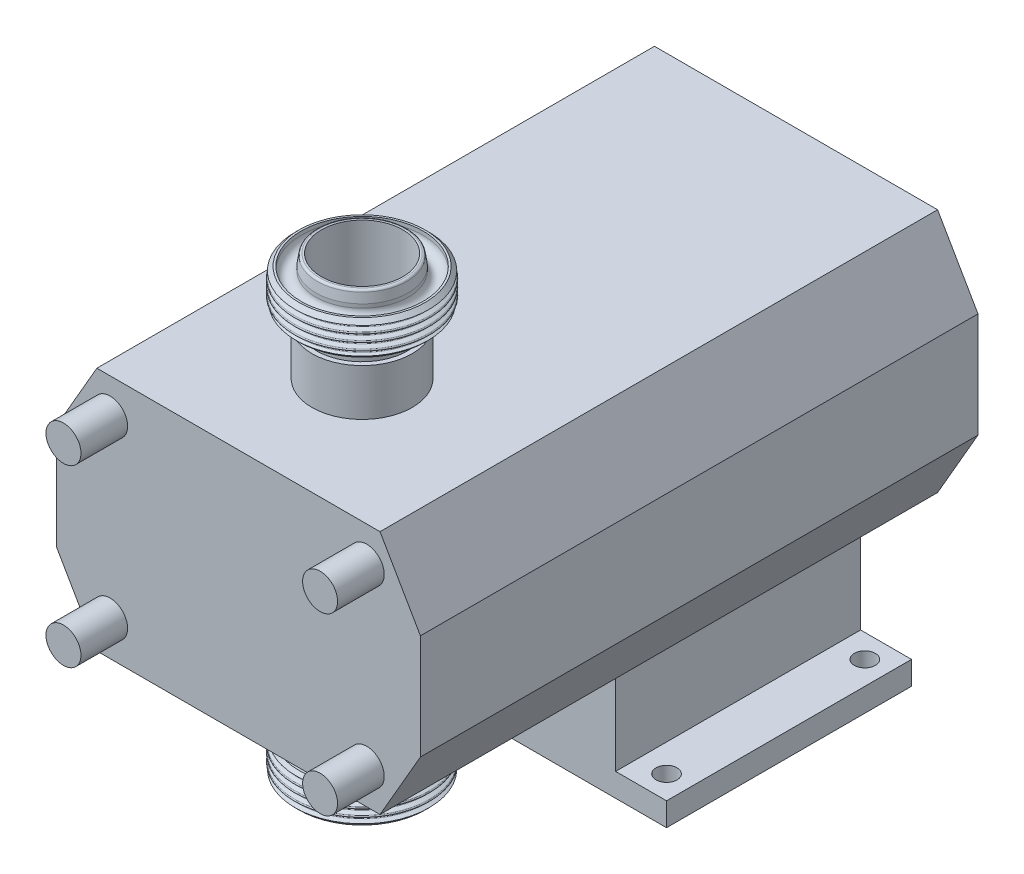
ISO-10303-21;
HEADER;
FILE_DESCRIPTION(('STEP AP214'),'2;1');
FILE_NAME('part.step','',(''),(''),'','','');
FILE_SCHEMA(('AUTOMOTIVE_DESIGN { 1 0 10303 214 1 1 1 1 }'));
ENDSEC;
DATA;
#1=APPLICATION_CONTEXT('core data for automotive mechanical design processes');
#2=APPLICATION_PROTOCOL_DEFINITION('international standard','automotive_design',2000,#1);
#3=PRODUCT_CONTEXT('',#1,'mechanical');
#4=PRODUCT('Part','Part','',(#3));
#5=PRODUCT_RELATED_PRODUCT_CATEGORY('part','',(#4));
#6=PRODUCT_DEFINITION_FORMATION('','',#4);
#7=PRODUCT_DEFINITION_CONTEXT('part definition',#1,'design');
#8=PRODUCT_DEFINITION('design','',#6,#7);
#9=PRODUCT_DEFINITION_SHAPE('','',#8);
#10=(LENGTH_UNIT() NAMED_UNIT(*) SI_UNIT(.MILLI.,.METRE.));
#11=(NAMED_UNIT(*) PLANE_ANGLE_UNIT() SI_UNIT($,.RADIAN.));
#12=(NAMED_UNIT(*) SI_UNIT($,.STERADIAN.) SOLID_ANGLE_UNIT());
#13=UNCERTAINTY_MEASURE_WITH_UNIT(LENGTH_MEASURE(1.E-05),#10,'distance_accuracy_value','');
#14=(GEOMETRIC_REPRESENTATION_CONTEXT(3) GLOBAL_UNCERTAINTY_ASSIGNED_CONTEXT((#13)) GLOBAL_UNIT_ASSIGNED_CONTEXT((#10,
#11,#12)) REPRESENTATION_CONTEXT('',''));
#15=CARTESIAN_POINT('',(0.,0.,0.));
#16=DIRECTION('',(0.,0.,1.));
#17=DIRECTION('',(1.,0.,0.));
#18=AXIS2_PLACEMENT_3D('',#15,#16,#17);
#19=CARTESIAN_POINT('',(-1.25945837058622,112.626198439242,83.5000000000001));
#20=DIRECTION('',(0.,-1.,0.));
#21=DIRECTION('',(0.668256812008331,0.,-0.743930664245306));
#22=AXIS2_PLACEMENT_3D('',#19,#20,#21);
#23=CONICAL_SURFACE('',#22,27.,0.785398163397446);
#24=CARTESIAN_POINT('',(-1.25945837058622,112.626198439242,83.5000000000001));
#25=DIRECTION('',(0.,1.,0.));
#26=DIRECTION('',(-0.668256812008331,0.,0.743930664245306));
#27=AXIS2_PLACEMENT_3D('',#24,#25,#26);
#28=CIRCLE('',#27,27.);
#29=CARTESIAN_POINT('',(-19.3023922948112,112.626198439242,103.586127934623));
#30=VERTEX_POINT('',#29);
#31=EDGE_CURVE('P0_E53',#30,#30,#28,.T.);
#32=ORIENTED_EDGE('',*,*,#31,.F.);
#33=EDGE_LOOP('',(#32));
#34=FACE_BOUND('',#33,.T.);
#35=CARTESIAN_POINT('',(-1.25945837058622,110.920778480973,83.5000000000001));
#36=DIRECTION('',(0.,1.,0.));
#37=DIRECTION('',(-0.668256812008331,0.,0.743930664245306));
#38=AXIS2_PLACEMENT_3D('',#35,#36,#37);
#39=CIRCLE('',#38,28.7054199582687);
#40=CARTESIAN_POINT('',(-20.4420507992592,110.920778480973,104.854842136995));
#41=VERTEX_POINT('',#40);
#42=EDGE_CURVE('P0_E19',#41,#41,#39,.T.);
#43=ORIENTED_EDGE('',*,*,#42,.T.);
#44=EDGE_LOOP('',(#43));
#45=FACE_BOUND('',#44,.T.);
#46=ADVANCED_FACE('P0_F15',(#34,#45),#23,.T.);
#47=CARTESIAN_POINT('',(-1.25945837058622,99.9261984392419,83.5000000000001));
#48=DIRECTION('',(0.,1.,0.));
#49=DIRECTION('',(-0.668256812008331,0.,0.743930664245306));
#50=AXIS2_PLACEMENT_3D('',#47,#48,#49);
#51=CONICAL_SURFACE('',#50,29.,0.785398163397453);
#52=CARTESIAN_POINT('',(-1.25945837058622,97.9261984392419,83.5000000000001));
#53=DIRECTION('',(0.,1.,0.));
#54=DIRECTION('',(-0.668256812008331,0.,0.743930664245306));
#55=AXIS2_PLACEMENT_3D('',#52,#53,#54);
#56=CIRCLE('',#55,27.);
#57=CARTESIAN_POINT('',(-19.3023922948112,97.9261984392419,103.586127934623));
#58=VERTEX_POINT('',#57);
#59=EDGE_CURVE('P0_E50',#58,#58,#56,.T.);
#60=ORIENTED_EDGE('',*,*,#59,.T.);
#61=EDGE_LOOP('',(#60));
#62=FACE_BOUND('',#61,.T.);
#63=CARTESIAN_POINT('',(-1.25945837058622,99.2534699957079,83.5000000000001));
#64=DIRECTION('',(0.,-1.,0.));
#65=DIRECTION('',(0.668256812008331,0.,-0.743930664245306));
#66=AXIS2_PLACEMENT_3D('',#63,#64,#65);
#67=CIRCLE('',#66,28.327271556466);
#68=CARTESIAN_POINT('',(17.670433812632,99.2534699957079,62.4264740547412));
#69=VERTEX_POINT('',#68);
#70=EDGE_CURVE('P0_E31',#69,#69,#67,.T.);
#71=ORIENTED_EDGE('',*,*,#70,.T.);
#72=EDGE_LOOP('',(#71));
#73=FACE_BOUND('',#72,.T.);
#74=ADVANCED_FACE('P0_F98',(#62,#73),#51,.T.);
#75=CARTESIAN_POINT('',(-1.25945837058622,95.4261984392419,83.5000000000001));
#76=DIRECTION('',(0.,1.,0.));
#77=DIRECTION('',(-0.668256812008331,0.,0.743930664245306));
#78=AXIS2_PLACEMENT_3D('',#75,#76,#77);
#79=TOROIDAL_SURFACE('',#78,22.,2.5);
#80=CARTESIAN_POINT('',(-1.25945837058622,95.4261984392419,83.5000000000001));
#81=DIRECTION('',(0.,1.,0.));
#82=DIRECTION('',(-0.668256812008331,0.,0.743930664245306));
#83=AXIS2_PLACEMENT_3D('',#80,#81,#82);
#84=CIRCLE('',#83,19.5);
#85=CARTESIAN_POINT('',(-14.2904662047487,95.4261984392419,98.0066479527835));
#86=VERTEX_POINT('',#85);
#87=EDGE_CURVE('P0_E10',#86,#86,#84,.T.);
#88=ORIENTED_EDGE('',*,*,#87,.T.);
#89=EDGE_LOOP('',(#88));
#90=FACE_BOUND('',#89,.T.);
#91=CARTESIAN_POINT('',(-1.25945837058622,97.9261984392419,83.5000000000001));
#92=DIRECTION('',(0.,1.,0.));
#93=DIRECTION('',(-0.668256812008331,0.,0.743930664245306));
#94=AXIS2_PLACEMENT_3D('',#91,#92,#93);
#95=CIRCLE('',#94,22.);
#96=CARTESIAN_POINT('',(-15.9611082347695,97.9261984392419,99.8664746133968));
#97=VERTEX_POINT('',#96);
#98=EDGE_CURVE('P0_E37',#97,#97,#95,.T.);
#99=ORIENTED_EDGE('',*,*,#98,.F.);
#100=EDGE_LOOP('',(#99));
#101=FACE_BOUND('',#100,.T.);
#102=ADVANCED_FACE('P0_F17',(#90,#101),#79,.F.);
#103=CARTESIAN_POINT('',(-1.25945837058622,128.647428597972,83.5000000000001));
#104=DIRECTION('',(0.,1.,0.));
#105=DIRECTION('',(-0.668256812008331,0.,0.743930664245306));
#106=AXIS2_PLACEMENT_3D('',#103,#104,#105);
#107=CYLINDRICAL_SURFACE('',#106,19.5);
#108=CARTESIAN_POINT('',(-1.25945837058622,90.9261984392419,83.5000000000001));
#109=DIRECTION('',(0.,1.,0.));
#110=DIRECTION('',(-0.668256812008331,0.,0.743930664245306));
#111=AXIS2_PLACEMENT_3D('',#108,#109,#110);
#112=CIRCLE('',#111,19.5);
#113=CARTESIAN_POINT('',(-14.2904662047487,90.9261984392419,98.0066479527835));
#114=VERTEX_POINT('',#113);
#115=EDGE_CURVE('P0_E23',#114,#114,#112,.T.);
#116=ORIENTED_EDGE('',*,*,#115,.T.);
#117=EDGE_LOOP('',(#116));
#118=FACE_BOUND('',#117,.T.);
#119=ORIENTED_EDGE('',*,*,#87,.F.);
#120=EDGE_LOOP('',(#119));
#121=FACE_BOUND('',#120,.T.);
#122=ADVANCED_FACE('P0_F95',(#118,#121),#107,.T.);
#123=CARTESIAN_POINT('',(-14.2410484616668,90.9261984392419,71.8389186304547));
#124=DIRECTION('',(0.,-1.,0.));
#125=DIRECTION('',(0.668256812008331,0.,-0.743930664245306));
#126=AXIS2_PLACEMENT_3D('',#123,#124,#125);
#127=PLANE('',#126);
#128=CARTESIAN_POINT('',(-1.25945837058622,90.9261984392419,83.5000000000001));
#129=DIRECTION('',(0.,1.,0.));
#130=DIRECTION('',(-0.668256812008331,0.,0.743930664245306));
#131=AXIS2_PLACEMENT_3D('',#128,#129,#130);
#132=CIRCLE('',#131,17.45);
#133=CARTESIAN_POINT('',(-12.9205397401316,90.9261984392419,96.4815900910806));
#134=VERTEX_POINT('',#133);
#135=EDGE_CURVE('P0_E28',#134,#134,#132,.T.);
#136=ORIENTED_EDGE('',*,*,#135,.T.);
#137=EDGE_LOOP('',(#136));
#138=FACE_BOUND('',#137,.T.);
#139=ORIENTED_EDGE('',*,*,#115,.F.);
#140=EDGE_LOOP('',(#139));
#141=FACE_BOUND('',#140,.T.);
#142=ADVANCED_FACE('P0_F79',(#138,#141),#127,.T.);
#143=CARTESIAN_POINT('',(-1.25945837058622,128.647428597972,83.5000000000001));
#144=DIRECTION('',(0.,1.,0.));
#145=DIRECTION('',(-0.668256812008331,0.,0.743930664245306));
#146=AXIS2_PLACEMENT_3D('',#143,#144,#145);
#147=CYLINDRICAL_SURFACE('',#146,17.45);
#148=CARTESIAN_POINT('',(-1.25945837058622,117.426198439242,83.5000000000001));
#149=DIRECTION('',(0.,1.,0.));
#150=DIRECTION('',(-0.668256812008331,0.,0.743930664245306));
#151=AXIS2_PLACEMENT_3D('',#148,#149,#150);
#152=CIRCLE('',#151,17.45);
#153=CARTESIAN_POINT('',(-12.9205397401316,117.426198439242,96.4815900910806));
#154=VERTEX_POINT('',#153);
#155=EDGE_CURVE('P0_E74',#154,#154,#152,.T.);
#156=ORIENTED_EDGE('',*,*,#155,.T.);
#157=EDGE_LOOP('',(#156));
#158=FACE_BOUND('',#157,.T.);
#159=ORIENTED_EDGE('',*,*,#135,.F.);
#160=EDGE_LOOP('',(#159));
#161=FACE_BOUND('',#160,.T.);
#162=ADVANCED_FACE('P0_F82',(#158,#161),#147,.F.);
#163=CARTESIAN_POINT('',(-14.8146041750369,117.426198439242,71.3237059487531));
#164=DIRECTION('',(0.,1.,0.));
#165=DIRECTION('',(-0.668256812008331,0.,0.743930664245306));
#166=AXIS2_PLACEMENT_3D('',#163,#164,#165);
#167=PLANE('',#166);
#168=CARTESIAN_POINT('',(-1.25945837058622,117.426198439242,83.5000000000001));
#169=DIRECTION('',(0.,1.,0.));
#170=DIRECTION('',(-0.668256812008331,0.,0.743930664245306));
#171=AXIS2_PLACEMENT_3D('',#168,#169,#170);
#172=CIRCLE('',#171,18.2209800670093);
#173=CARTESIAN_POINT('',(-13.4357524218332,117.426198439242,97.0551458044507));
#174=VERTEX_POINT('',#173);
#175=EDGE_CURVE('P0_E71',#174,#174,#172,.T.);
#176=ORIENTED_EDGE('',*,*,#175,.T.);
#177=EDGE_LOOP('',(#176));
#178=FACE_BOUND('',#177,.T.);
#179=ORIENTED_EDGE('',*,*,#155,.F.);
#180=EDGE_LOOP('',(#179));
#181=FACE_BOUND('',#180,.T.);
#182=ADVANCED_FACE('P0_F84',(#178,#181),#167,.T.);
#183=CARTESIAN_POINT('',(-1.25945837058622,116.426198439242,83.5000000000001));
#184=DIRECTION('',(0.,1.,0.));
#185=DIRECTION('',(-0.668256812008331,0.,0.743930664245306));
#186=AXIS2_PLACEMENT_3D('',#183,#184,#185);
#187=TOROIDAL_SURFACE('',#186,18.2209800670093,1.);
#188=CARTESIAN_POINT('',(-1.25945837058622,116.574007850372,83.5000000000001));
#189=DIRECTION('',(0.,1.,0.));
#190=DIRECTION('',(-0.668256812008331,0.,0.743930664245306));
#191=AXIS2_PLACEMENT_3D('',#188,#189,#190);
#192=CIRCLE('',#191,19.2099959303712);
#193=CARTESIAN_POINT('',(-14.0966690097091,116.574007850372,97.7909050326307));
#194=VERTEX_POINT('',#193);
#195=EDGE_CURVE('P0_E68',#194,#194,#192,.T.);
#196=ORIENTED_EDGE('',*,*,#195,.T.);
#197=EDGE_LOOP('',(#196));
#198=FACE_BOUND('',#197,.T.);
#199=ORIENTED_EDGE('',*,*,#175,.F.);
#200=EDGE_LOOP('',(#199));
#201=FACE_BOUND('',#200,.T.);
#202=ADVANCED_FACE('P0_F92',(#198,#201),#187,.T.);
#203=CARTESIAN_POINT('',(-1.25945837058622,116.574007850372,83.5000000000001));
#204=DIRECTION('',(0.,-1.,0.));
#205=DIRECTION('',(0.668256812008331,0.,-0.743930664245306));
#206=AXIS2_PLACEMENT_3D('',#203,#204,#205);
#207=CONICAL_SURFACE('',#206,19.2099959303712,0.148352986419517);
#208=CARTESIAN_POINT('',(-1.25945837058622,112.626198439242,83.5000000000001));
#209=DIRECTION('',(0.,1.,0.));
#210=DIRECTION('',(-0.668256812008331,0.,0.743930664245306));
#211=AXIS2_PLACEMENT_3D('',#208,#209,#210);
#212=CIRCLE('',#211,19.8);
#213=CARTESIAN_POINT('',(-14.4909432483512,112.626198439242,98.2298271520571));
#214=VERTEX_POINT('',#213);
#215=EDGE_CURVE('P0_E65',#214,#214,#212,.T.);
#216=ORIENTED_EDGE('',*,*,#215,.T.);
#217=EDGE_LOOP('',(#216));
#218=FACE_BOUND('',#217,.T.);
#219=ORIENTED_EDGE('',*,*,#195,.F.);
#220=EDGE_LOOP('',(#219));
#221=FACE_BOUND('',#220,.T.);
#222=ADVANCED_FACE('P0_F126',(#218,#221),#207,.T.);
#223=CARTESIAN_POINT('',(-1.25945837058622,128.647428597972,83.5000000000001));
#224=DIRECTION('',(0.,1.,0.));
#225=DIRECTION('',(-0.668256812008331,0.,0.743930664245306));
#226=AXIS2_PLACEMENT_3D('',#223,#224,#225);
#227=CYLINDRICAL_SURFACE('',#226,19.8);
#228=CARTESIAN_POINT('',(-1.25945837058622,111.026198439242,83.5000000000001));
#229=DIRECTION('',(0.,1.,0.));
#230=DIRECTION('',(-0.668256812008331,0.,0.743930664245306));
#231=AXIS2_PLACEMENT_3D('',#228,#229,#230);
#232=CIRCLE('',#231,19.8);
#233=CARTESIAN_POINT('',(-14.4909432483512,111.026198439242,98.2298271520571));
#234=VERTEX_POINT('',#233);
#235=EDGE_CURVE('P0_E62',#234,#234,#232,.T.);
#236=ORIENTED_EDGE('',*,*,#235,.T.);
#237=EDGE_LOOP('',(#236));
#238=FACE_BOUND('',#237,.T.);
#239=ORIENTED_EDGE('',*,*,#215,.F.);
#240=EDGE_LOOP('',(#239));
#241=FACE_BOUND('',#240,.T.);
#242=ADVANCED_FACE('P0_F122',(#238,#241),#227,.T.);
#243=CARTESIAN_POINT('',(-1.25945837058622,111.026198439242,83.5000000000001));
#244=DIRECTION('',(0.,1.,0.));
#245=DIRECTION('',(-0.668256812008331,0.,0.743930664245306));
#246=AXIS2_PLACEMENT_3D('',#243,#244,#245);
#247=TOROIDAL_SURFACE('',#246,22.975,3.175);
#248=CARTESIAN_POINT('',(-1.25945837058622,111.026198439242,83.5000000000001));
#249=DIRECTION('',(0.,1.,0.));
#250=DIRECTION('',(-0.668256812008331,0.,0.743930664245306));
#251=AXIS2_PLACEMENT_3D('',#248,#249,#250);
#252=CIRCLE('',#251,26.15);
#253=CARTESIAN_POINT('',(-18.7343740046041,111.026198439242,102.953786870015));
#254=VERTEX_POINT('',#253);
#255=EDGE_CURVE('P0_E59',#254,#254,#252,.T.);
#256=ORIENTED_EDGE('',*,*,#255,.T.);
#257=EDGE_LOOP('',(#256));
#258=FACE_BOUND('',#257,.T.);
#259=ORIENTED_EDGE('',*,*,#235,.F.);
#260=EDGE_LOOP('',(#259));
#261=FACE_BOUND('',#260,.T.);
#262=ADVANCED_FACE('P0_F118',(#258,#261),#247,.F.);
#263=CARTESIAN_POINT('',(-1.25945837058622,128.647428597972,83.5000000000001));
#264=DIRECTION('',(0.,1.,0.));
#265=DIRECTION('',(-0.668256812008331,0.,0.743930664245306));
#266=AXIS2_PLACEMENT_3D('',#263,#264,#265);
#267=CYLINDRICAL_SURFACE('',#266,26.15);
#268=CARTESIAN_POINT('',(-1.25945837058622,112.626198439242,83.5000000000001));
#269=DIRECTION('',(0.,1.,0.));
#270=DIRECTION('',(-0.668256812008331,0.,0.743930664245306));
#271=AXIS2_PLACEMENT_3D('',#268,#269,#270);
#272=CIRCLE('',#271,26.15);
#273=CARTESIAN_POINT('',(-18.7343740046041,112.626198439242,102.953786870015));
#274=VERTEX_POINT('',#273);
#275=EDGE_CURVE('P0_E56',#274,#274,#272,.T.);
#276=ORIENTED_EDGE('',*,*,#275,.T.);
#277=EDGE_LOOP('',(#276));
#278=FACE_BOUND('',#277,.T.);
#279=ORIENTED_EDGE('',*,*,#255,.F.);
#280=EDGE_LOOP('',(#279));
#281=FACE_BOUND('',#280,.T.);
#282=ADVANCED_FACE('P0_F114',(#278,#281),#267,.F.);
#283=CARTESIAN_POINT('',(-21.3455863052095,112.626198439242,65.4570660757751));
#284=DIRECTION('',(0.,1.,0.));
#285=DIRECTION('',(-0.668256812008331,0.,0.743930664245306));
#286=AXIS2_PLACEMENT_3D('',#283,#284,#285);
#287=PLANE('',#286);
#288=ORIENTED_EDGE('',*,*,#31,.T.);
#289=EDGE_LOOP('',(#288));
#290=FACE_BOUND('',#289,.T.);
#291=ORIENTED_EDGE('',*,*,#275,.F.);
#292=EDGE_LOOP('',(#291));
#293=FACE_BOUND('',#292,.T.);
#294=ADVANCED_FACE('P0_F110',(#290,#293),#287,.T.);
#295=CARTESIAN_POINT('',(-17.6259329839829,97.9261984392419,68.7983501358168));
#296=DIRECTION('',(0.,-1.,0.));
#297=DIRECTION('',(0.668256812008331,0.,-0.743930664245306));
#298=AXIS2_PLACEMENT_3D('',#295,#296,#297);
#299=PLANE('',#298);
#300=ORIENTED_EDGE('',*,*,#98,.T.);
#301=EDGE_LOOP('',(#300));
#302=FACE_BOUND('',#301,.T.);
#303=ORIENTED_EDGE('',*,*,#59,.F.);
#304=EDGE_LOOP('',(#303));
#305=FACE_BOUND('',#304,.T.);
#306=ADVANCED_FACE('P0_F113',(#302,#305),#299,.T.);
#307=CARTESIAN_POINT('',(-1.25945837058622,108.163698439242,83.5000000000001));
#308=DIRECTION('',(0.,1.,0.));
#309=DIRECTION('',(-0.668256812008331,0.,0.743930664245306));
#310=AXIS2_PLACEMENT_3D('',#307,#308,#309);
#311=TOROIDAL_SURFACE('',#310,28.564,0.435999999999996);
#312=CARTESIAN_POINT('',(-1.25945837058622,108.550435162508,83.5000000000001));
#313=DIRECTION('',(0.,1.,0.));
#314=DIRECTION('',(-0.668256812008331,0.,0.743930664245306));
#315=AXIS2_PLACEMENT_3D('',#312,#313,#314);
#316=CIRCLE('',#315,28.7653223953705);
#317=CARTESIAN_POINT('',(-20.4820810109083,108.550435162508,104.899405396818));
#318=VERTEX_POINT('',#317);
#319=EDGE_CURVE('P0_E44',#318,#318,#316,.T.);
#320=ORIENTED_EDGE('',*,*,#319,.F.);
#321=EDGE_LOOP('',(#320));
#322=FACE_BOUND('',#321,.T.);
#323=CARTESIAN_POINT('',(-1.25945837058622,107.776961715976,83.5000000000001));
#324=DIRECTION('',(0.,1.,0.));
#325=DIRECTION('',(-0.668256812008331,0.,0.743930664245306));
#326=AXIS2_PLACEMENT_3D('',#323,#324,#325);
#327=CIRCLE('',#326,28.7653223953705);
#328=CARTESIAN_POINT('',(-20.4820810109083,107.776961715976,104.899405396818));
#329=VERTEX_POINT('',#328);
#330=EDGE_CURVE('P0_E329',#329,#329,#327,.T.);
#331=ORIENTED_EDGE('',*,*,#330,.T.);
#332=EDGE_LOOP('',(#331));
#333=FACE_BOUND('',#332,.T.);
#334=ADVANCED_FACE('P0_F172',(#322,#333),#311,.T.);
#335=CARTESIAN_POINT('',(-1.25945837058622,104.988698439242,83.5000000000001));
#336=DIRECTION('',(0.,1.,0.));
#337=DIRECTION('',(-0.668256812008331,0.,0.743930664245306));
#338=AXIS2_PLACEMENT_3D('',#335,#336,#337);
#339=TOROIDAL_SURFACE('',#338,28.564,0.435999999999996);
#340=CARTESIAN_POINT('',(-1.25945837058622,105.375435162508,83.5000000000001));
#341=DIRECTION('',(0.,1.,0.));
#342=DIRECTION('',(-0.668256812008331,0.,0.743930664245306));
#343=AXIS2_PLACEMENT_3D('',#340,#341,#342);
#344=CIRCLE('',#343,28.7653223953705);
#345=CARTESIAN_POINT('',(-20.4820810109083,105.375435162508,104.899405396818));
#346=VERTEX_POINT('',#345);
#347=EDGE_CURVE('P0_E320',#346,#346,#344,.T.);
#348=ORIENTED_EDGE('',*,*,#347,.F.);
#349=EDGE_LOOP('',(#348));
#350=FACE_BOUND('',#349,.T.);
#351=CARTESIAN_POINT('',(-1.25945837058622,104.601961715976,83.5000000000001));
#352=DIRECTION('',(0.,1.,0.));
#353=DIRECTION('',(-0.668256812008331,0.,0.743930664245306));
#354=AXIS2_PLACEMENT_3D('',#351,#352,#353);
#355=CIRCLE('',#354,28.7653223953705);
#356=CARTESIAN_POINT('',(-20.4820810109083,104.601961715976,104.899405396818));
#357=VERTEX_POINT('',#356);
#358=EDGE_CURVE('P0_E317',#357,#357,#355,.T.);
#359=ORIENTED_EDGE('',*,*,#358,.T.);
#360=EDGE_LOOP('',(#359));
#361=FACE_BOUND('',#360,.T.);
#362=ADVANCED_FACE('P0_F179',(#350,#361),#339,.T.);
#363=CARTESIAN_POINT('',(-1.25945837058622,101.813698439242,83.5000000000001));
#364=DIRECTION('',(0.,1.,0.));
#365=DIRECTION('',(-0.668256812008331,0.,0.743930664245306));
#366=AXIS2_PLACEMENT_3D('',#363,#364,#365);
#367=TOROIDAL_SURFACE('',#366,28.564,0.435999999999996);
#368=CARTESIAN_POINT('',(-1.25945837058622,102.200435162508,83.5000000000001));
#369=DIRECTION('',(0.,1.,0.));
#370=DIRECTION('',(-0.668256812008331,0.,0.743930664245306));
#371=AXIS2_PLACEMENT_3D('',#368,#369,#370);
#372=CIRCLE('',#371,28.7653223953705);
#373=CARTESIAN_POINT('',(-20.4820810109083,102.200435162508,104.899405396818));
#374=VERTEX_POINT('',#373);
#375=EDGE_CURVE('P0_E308',#374,#374,#372,.T.);
#376=ORIENTED_EDGE('',*,*,#375,.F.);
#377=EDGE_LOOP('',(#376));
#378=FACE_BOUND('',#377,.T.);
#379=CARTESIAN_POINT('',(-1.25945837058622,101.426961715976,83.5000000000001));
#380=DIRECTION('',(0.,1.,0.));
#381=DIRECTION('',(-0.668256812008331,0.,0.743930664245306));
#382=AXIS2_PLACEMENT_3D('',#379,#380,#381);
#383=CIRCLE('',#382,28.7653223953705);
#384=CARTESIAN_POINT('',(-20.4820810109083,101.426961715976,104.899405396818));
#385=VERTEX_POINT('',#384);
#386=EDGE_CURVE('P0_E303',#385,#385,#383,.T.);
#387=ORIENTED_EDGE('',*,*,#386,.T.);
#388=EDGE_LOOP('',(#387));
#389=FACE_BOUND('',#388,.T.);
#390=ADVANCED_FACE('P0_F187',(#378,#389),#367,.T.);
#391=CARTESIAN_POINT('',(-1.25945837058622,110.951961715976,83.5000000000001));
#392=DIRECTION('',(0.,1.,0.));
#393=DIRECTION('',(-0.668256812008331,0.,0.743930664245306));
#394=AXIS2_PLACEMENT_3D('',#391,#392,#393);
#395=CONICAL_SURFACE('',#394,28.7653223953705,1.09083078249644);
#396=ORIENTED_EDGE('',*,*,#42,.F.);
#397=EDGE_LOOP('',(#396));
#398=FACE_BOUND('',#397,.T.);
#399=CARTESIAN_POINT('',(-1.25945837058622,110.137935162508,83.5000000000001));
#400=DIRECTION('',(0.,1.,0.));
#401=DIRECTION('',(-0.668256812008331,0.,0.743930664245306));
#402=AXIS2_PLACEMENT_3D('',#399,#400,#401);
#403=CIRCLE('',#402,27.2015919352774);
#404=CARTESIAN_POINT('',(-19.4371074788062,110.137935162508,103.736098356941));
#405=VERTEX_POINT('',#404);
#406=EDGE_CURVE('P0_E33',#405,#405,#403,.T.);
#407=ORIENTED_EDGE('',*,*,#406,.T.);
#408=EDGE_LOOP('',(#407));
#409=FACE_BOUND('',#408,.T.);
#410=ADVANCED_FACE('P0_F195',(#398,#409),#395,.T.);
#411=CARTESIAN_POINT('',(-1.25945837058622,109.751198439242,83.5000000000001));
#412=DIRECTION('',(0.,1.,0.));
#413=DIRECTION('',(-0.668256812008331,0.,0.743930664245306));
#414=AXIS2_PLACEMENT_3D('',#411,#412,#413);
#415=TOROIDAL_SURFACE('',#414,27.4029143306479,0.436000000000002);
#416=CARTESIAN_POINT('',(-1.25945837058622,109.364461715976,83.5000000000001));
#417=DIRECTION('',(0.,1.,0.));
#418=DIRECTION('',(-0.668256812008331,0.,0.743930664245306));
#419=AXIS2_PLACEMENT_3D('',#416,#417,#418);
#420=CIRCLE('',#419,27.2015919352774);
#421=CARTESIAN_POINT('',(-19.4371074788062,109.364461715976,103.736098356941));
#422=VERTEX_POINT('',#421);
#423=EDGE_CURVE('P0_E39',#422,#422,#420,.T.);
#424=ORIENTED_EDGE('',*,*,#423,.T.);
#425=EDGE_LOOP('',(#424));
#426=FACE_BOUND('',#425,.T.);
#427=ORIENTED_EDGE('',*,*,#406,.F.);
#428=EDGE_LOOP('',(#427));
#429=FACE_BOUND('',#428,.T.);
#430=ADVANCED_FACE('P0_F203',(#426,#429),#415,.F.);
#431=CARTESIAN_POINT('',(-1.25945837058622,109.364461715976,83.5000000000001));
#432=DIRECTION('',(0.,-1.,0.));
#433=DIRECTION('',(0.668256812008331,0.,-0.743930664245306));
#434=AXIS2_PLACEMENT_3D('',#431,#432,#433);
#435=CONICAL_SURFACE('',#434,27.2015919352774,1.09083078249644);
#436=ORIENTED_EDGE('',*,*,#319,.T.);
#437=EDGE_LOOP('',(#436));
#438=FACE_BOUND('',#437,.T.);
#439=ORIENTED_EDGE('',*,*,#423,.F.);
#440=EDGE_LOOP('',(#439));
#441=FACE_BOUND('',#440,.T.);
#442=ADVANCED_FACE('P0_F211',(#438,#441),#435,.T.);
#443=CARTESIAN_POINT('',(-1.25945837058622,107.776961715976,83.5000000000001));
#444=DIRECTION('',(0.,1.,0.));
#445=DIRECTION('',(-0.668256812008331,0.,0.743930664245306));
#446=AXIS2_PLACEMENT_3D('',#443,#444,#445);
#447=CONICAL_SURFACE('',#446,28.7653223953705,1.09083078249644);
#448=CARTESIAN_POINT('',(-1.25945837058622,106.962935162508,83.5000000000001));
#449=DIRECTION('',(0.,1.,0.));
#450=DIRECTION('',(-0.668256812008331,0.,0.743930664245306));
#451=AXIS2_PLACEMENT_3D('',#448,#449,#450);
#452=CIRCLE('',#451,27.2015919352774);
#453=CARTESIAN_POINT('',(-19.4371074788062,106.962935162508,103.736098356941));
#454=VERTEX_POINT('',#453);
#455=EDGE_CURVE('P0_E326',#454,#454,#452,.T.);
#456=ORIENTED_EDGE('',*,*,#455,.T.);
#457=EDGE_LOOP('',(#456));
#458=FACE_BOUND('',#457,.T.);
#459=ORIENTED_EDGE('',*,*,#330,.F.);
#460=EDGE_LOOP('',(#459));
#461=FACE_BOUND('',#460,.T.);
#462=ADVANCED_FACE('P0_F219',(#458,#461),#447,.T.);
#463=CARTESIAN_POINT('',(-1.25945837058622,106.576198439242,83.5000000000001));
#464=DIRECTION('',(0.,1.,0.));
#465=DIRECTION('',(-0.668256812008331,0.,0.743930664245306));
#466=AXIS2_PLACEMENT_3D('',#463,#464,#465);
#467=TOROIDAL_SURFACE('',#466,27.4029143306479,0.436000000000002);
#468=CARTESIAN_POINT('',(-1.25945837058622,106.189461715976,83.5000000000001));
#469=DIRECTION('',(0.,1.,0.));
#470=DIRECTION('',(-0.668256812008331,0.,0.743930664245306));
#471=AXIS2_PLACEMENT_3D('',#468,#469,#470);
#472=CIRCLE('',#471,27.2015919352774);
#473=CARTESIAN_POINT('',(-19.4371074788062,106.189461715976,103.736098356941));
#474=VERTEX_POINT('',#473);
#475=EDGE_CURVE('P0_E323',#474,#474,#472,.T.);
#476=ORIENTED_EDGE('',*,*,#475,.T.);
#477=EDGE_LOOP('',(#476));
#478=FACE_BOUND('',#477,.T.);
#479=ORIENTED_EDGE('',*,*,#455,.F.);
#480=EDGE_LOOP('',(#479));
#481=FACE_BOUND('',#480,.T.);
#482=ADVANCED_FACE('P0_F227',(#478,#481),#467,.F.);
#483=CARTESIAN_POINT('',(-1.25945837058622,106.189461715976,83.5000000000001));
#484=DIRECTION('',(0.,-1.,0.));
#485=DIRECTION('',(0.668256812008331,0.,-0.743930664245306));
#486=AXIS2_PLACEMENT_3D('',#483,#484,#485);
#487=CONICAL_SURFACE('',#486,27.2015919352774,1.09083078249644);
#488=ORIENTED_EDGE('',*,*,#347,.T.);
#489=EDGE_LOOP('',(#488));
#490=FACE_BOUND('',#489,.T.);
#491=ORIENTED_EDGE('',*,*,#475,.F.);
#492=EDGE_LOOP('',(#491));
#493=FACE_BOUND('',#492,.T.);
#494=ADVANCED_FACE('P0_F235',(#490,#493),#487,.T.);
#495=CARTESIAN_POINT('',(-1.25945837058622,104.601961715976,83.5000000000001));
#496=DIRECTION('',(0.,1.,0.));
#497=DIRECTION('',(-0.668256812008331,0.,0.743930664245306));
#498=AXIS2_PLACEMENT_3D('',#495,#496,#497);
#499=CONICAL_SURFACE('',#498,28.7653223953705,1.09083078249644);
#500=CARTESIAN_POINT('',(-1.25945837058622,103.787935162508,83.5000000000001));
#501=DIRECTION('',(0.,1.,0.));
#502=DIRECTION('',(-0.668256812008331,0.,0.743930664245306));
#503=AXIS2_PLACEMENT_3D('',#500,#501,#502);
#504=CIRCLE('',#503,27.2015919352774);
#505=CARTESIAN_POINT('',(-19.4371074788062,103.787935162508,103.736098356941));
#506=VERTEX_POINT('',#505);
#507=EDGE_CURVE('P0_E314',#506,#506,#504,.T.);
#508=ORIENTED_EDGE('',*,*,#507,.T.);
#509=EDGE_LOOP('',(#508));
#510=FACE_BOUND('',#509,.T.);
#511=ORIENTED_EDGE('',*,*,#358,.F.);
#512=EDGE_LOOP('',(#511));
#513=FACE_BOUND('',#512,.T.);
#514=ADVANCED_FACE('P0_F243',(#510,#513),#499,.T.);
#515=CARTESIAN_POINT('',(-1.25945837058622,103.401198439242,83.5000000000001));
#516=DIRECTION('',(0.,1.,0.));
#517=DIRECTION('',(-0.668256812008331,0.,0.743930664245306));
#518=AXIS2_PLACEMENT_3D('',#515,#516,#517);
#519=TOROIDAL_SURFACE('',#518,27.4029143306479,0.436000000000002);
#520=CARTESIAN_POINT('',(-1.25945837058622,103.014461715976,83.5000000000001));
#521=DIRECTION('',(0.,1.,0.));
#522=DIRECTION('',(-0.668256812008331,0.,0.743930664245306));
#523=AXIS2_PLACEMENT_3D('',#520,#521,#522);
#524=CIRCLE('',#523,27.2015919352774);
#525=CARTESIAN_POINT('',(-19.4371074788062,103.014461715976,103.736098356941));
#526=VERTEX_POINT('',#525);
#527=EDGE_CURVE('P0_E311',#526,#526,#524,.T.);
#528=ORIENTED_EDGE('',*,*,#527,.T.);
#529=EDGE_LOOP('',(#528));
#530=FACE_BOUND('',#529,.T.);
#531=ORIENTED_EDGE('',*,*,#507,.F.);
#532=EDGE_LOOP('',(#531));
#533=FACE_BOUND('',#532,.T.);
#534=ADVANCED_FACE('P0_F251',(#530,#533),#519,.F.);
#535=CARTESIAN_POINT('',(-1.25945837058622,103.014461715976,83.5000000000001));
#536=DIRECTION('',(0.,-1.,0.));
#537=DIRECTION('',(0.668256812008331,0.,-0.743930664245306));
#538=AXIS2_PLACEMENT_3D('',#535,#536,#537);
#539=CONICAL_SURFACE('',#538,27.2015919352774,1.09083078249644);
#540=ORIENTED_EDGE('',*,*,#375,.T.);
#541=EDGE_LOOP('',(#540));
#542=FACE_BOUND('',#541,.T.);
#543=ORIENTED_EDGE('',*,*,#527,.F.);
#544=EDGE_LOOP('',(#543));
#545=FACE_BOUND('',#544,.T.);
#546=ADVANCED_FACE('P0_F259',(#542,#545),#539,.T.);
#547=CARTESIAN_POINT('',(-1.25945837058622,101.426961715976,83.5000000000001));
#548=DIRECTION('',(0.,1.,0.));
#549=DIRECTION('',(-0.668256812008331,0.,0.743930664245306));
#550=AXIS2_PLACEMENT_3D('',#547,#548,#549);
#551=CONICAL_SURFACE('',#550,28.7653223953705,1.09083078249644);
#552=CARTESIAN_POINT('',(-1.25945837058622,100.612935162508,83.5000000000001));
#553=DIRECTION('',(0.,1.,0.));
#554=DIRECTION('',(-0.668256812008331,0.,0.743930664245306));
#555=AXIS2_PLACEMENT_3D('',#552,#553,#554);
#556=CIRCLE('',#555,27.2015919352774);
#557=CARTESIAN_POINT('',(-19.4371074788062,100.612935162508,103.736098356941));
#558=VERTEX_POINT('',#557);
#559=EDGE_CURVE('P0_E300',#558,#558,#556,.T.);
#560=ORIENTED_EDGE('',*,*,#559,.T.);
#561=EDGE_LOOP('',(#560));
#562=FACE_BOUND('',#561,.T.);
#563=ORIENTED_EDGE('',*,*,#386,.F.);
#564=EDGE_LOOP('',(#563));
#565=FACE_BOUND('',#564,.T.);
#566=ADVANCED_FACE('P0_F267',(#562,#565),#551,.T.);
#567=CARTESIAN_POINT('',(-1.25945837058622,100.226198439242,83.5000000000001));
#568=DIRECTION('',(0.,1.,0.));
#569=DIRECTION('',(-0.668256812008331,0.,0.743930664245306));
#570=AXIS2_PLACEMENT_3D('',#567,#568,#569);
#571=TOROIDAL_SURFACE('',#570,27.4029143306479,0.436000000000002);
#572=CARTESIAN_POINT('',(-1.25945837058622,99.8394617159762,83.5000000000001));
#573=DIRECTION('',(0.,1.,0.));
#574=DIRECTION('',(-0.668256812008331,0.,0.743930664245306));
#575=AXIS2_PLACEMENT_3D('',#572,#573,#574);
#576=CIRCLE('',#575,27.2015919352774);
#577=CARTESIAN_POINT('',(-19.4371074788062,99.8394617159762,103.736098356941));
#578=VERTEX_POINT('',#577);
#579=EDGE_CURVE('P0_E299',#578,#578,#576,.T.);
#580=ORIENTED_EDGE('',*,*,#579,.T.);
#581=EDGE_LOOP('',(#580));
#582=FACE_BOUND('',#581,.T.);
#583=ORIENTED_EDGE('',*,*,#559,.F.);
#584=EDGE_LOOP('',(#583));
#585=FACE_BOUND('',#584,.T.);
#586=ADVANCED_FACE('P0_F275',(#582,#585),#571,.F.);
#587=CARTESIAN_POINT('',(-1.25945837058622,99.8394617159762,83.5000000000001));
#588=DIRECTION('',(0.,-1.,0.));
#589=DIRECTION('',(0.668256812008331,0.,-0.743930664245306));
#590=AXIS2_PLACEMENT_3D('',#587,#588,#589);
#591=CONICAL_SURFACE('',#590,27.2015919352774,1.09083078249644);
#592=ORIENTED_EDGE('',*,*,#70,.F.);
#593=EDGE_LOOP('',(#592));
#594=FACE_BOUND('',#593,.T.);
#595=ORIENTED_EDGE('',*,*,#579,.F.);
#596=EDGE_LOOP('',(#595));
#597=FACE_BOUND('',#596,.T.);
#598=ADVANCED_FACE('P0_F283',(#594,#597),#591,.T.);
#599=CLOSED_SHELL('',(#46,#74,#102,#122,#142,#162,#182,#202,#222,#242,#262,#282,#294,#306,#334,
#362,#390,#410,#430,#442,#462,#482,#494,#514,#534,#546,#566,#586,#598));
#600=MANIFOLD_SOLID_BREP('P0_B1',#599);
#601=CARTESIAN_POINT('',(-1.25945837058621,-75.7738015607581,83.5));
#602=DIRECTION('',(0.,1.,0.));
#603=DIRECTION('',(-0.744239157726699,0.,-0.667913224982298));
#604=AXIS2_PLACEMENT_3D('',#601,#602,#603);
#605=CONICAL_SURFACE('',#604,27.,0.785398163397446);
#606=CARTESIAN_POINT('',(-1.25945837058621,-75.7738015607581,83.5));
#607=DIRECTION('',(0.,-1.,0.));
#608=DIRECTION('',(0.744239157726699,0.,0.667913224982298));
#609=AXIS2_PLACEMENT_3D('',#606,#607,#608);
#610=CIRCLE('',#609,27.);
#611=CARTESIAN_POINT('',(18.8349988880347,-75.7738015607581,101.533657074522));
#612=VERTEX_POINT('',#611);
#613=EDGE_CURVE('P1_E52',#612,#612,#610,.T.);
#614=ORIENTED_EDGE('',*,*,#613,.F.);
#615=EDGE_LOOP('',(#614));
#616=FACE_BOUND('',#615,.T.);
#617=CARTESIAN_POINT('',(-1.25945837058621,-74.0683816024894,83.5));
#618=DIRECTION('',(0.,-1.,0.));
#619=DIRECTION('',(0.744239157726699,0.,0.667913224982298));
#620=AXIS2_PLACEMENT_3D('',#617,#618,#619);
#621=CIRCLE('',#620,28.7054199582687);
#622=CARTESIAN_POINT('',(20.1042392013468,-74.0683816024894,102.672729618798));
#623=VERTEX_POINT('',#622);
#624=EDGE_CURVE('P1_E18',#623,#623,#621,.T.);
#625=ORIENTED_EDGE('',*,*,#624,.T.);
#626=EDGE_LOOP('',(#625));
#627=FACE_BOUND('',#626,.T.);
#628=ADVANCED_FACE('P1_F14',(#616,#627),#605,.T.);
#629=CARTESIAN_POINT('',(-1.25945837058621,-63.0738015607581,83.5));
#630=DIRECTION('',(0.,-1.,0.));
#631=DIRECTION('',(0.744239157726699,0.,0.667913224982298));
#632=AXIS2_PLACEMENT_3D('',#629,#630,#631);
#633=CONICAL_SURFACE('',#632,29.,0.785398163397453);
#634=CARTESIAN_POINT('',(-1.25945837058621,-61.0738015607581,83.5));
#635=DIRECTION('',(0.,-1.,0.));
#636=DIRECTION('',(0.744239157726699,0.,0.667913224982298));
#637=AXIS2_PLACEMENT_3D('',#634,#635,#636);
#638=CIRCLE('',#637,27.);
#639=CARTESIAN_POINT('',(18.8349988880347,-61.0738015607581,101.533657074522));
#640=VERTEX_POINT('',#639);
#641=EDGE_CURVE('P1_E49',#640,#640,#638,.T.);
#642=ORIENTED_EDGE('',*,*,#641,.T.);
#643=EDGE_LOOP('',(#642));
#644=FACE_BOUND('',#643,.T.);
#645=CARTESIAN_POINT('',(-1.25945837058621,-62.401073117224,83.5));
#646=DIRECTION('',(0.,1.,0.));
#647=DIRECTION('',(-0.744239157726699,0.,-0.667913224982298));
#648=AXIS2_PLACEMENT_3D('',#645,#646,#647);
#649=CIRCLE('',#648,28.327271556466);
#650=CARTESIAN_POINT('',(-22.3417230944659,-62.401073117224,64.5798406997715));
#651=VERTEX_POINT('',#650);
#652=EDGE_CURVE('P1_E30',#651,#651,#649,.T.);
#653=ORIENTED_EDGE('',*,*,#652,.T.);
#654=EDGE_LOOP('',(#653));
#655=FACE_BOUND('',#654,.T.);
#656=ADVANCED_FACE('P1_F97',(#644,#655),#633,.T.);
#657=CARTESIAN_POINT('',(-1.25945837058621,-58.5738015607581,83.5));
#658=DIRECTION('',(0.,-1.,0.));
#659=DIRECTION('',(0.744239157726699,0.,0.667913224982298));
#660=AXIS2_PLACEMENT_3D('',#657,#658,#659);
#661=TOROIDAL_SURFACE('',#660,22.,2.5);
#662=CARTESIAN_POINT('',(-1.25945837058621,-58.5738015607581,83.5));
#663=DIRECTION('',(0.,-1.,0.));
#664=DIRECTION('',(0.744239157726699,0.,0.667913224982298));
#665=AXIS2_PLACEMENT_3D('',#662,#663,#664);
#666=CIRCLE('',#665,19.5);
#667=CARTESIAN_POINT('',(13.2532052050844,-58.5738015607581,96.5243078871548));
#668=VERTEX_POINT('',#667);
#669=EDGE_CURVE('P1_E9',#668,#668,#666,.T.);
#670=ORIENTED_EDGE('',*,*,#669,.T.);
#671=EDGE_LOOP('',(#670));
#672=FACE_BOUND('',#671,.T.);
#673=CARTESIAN_POINT('',(-1.25945837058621,-61.0738015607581,83.5));
#674=DIRECTION('',(0.,-1.,0.));
#675=DIRECTION('',(0.744239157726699,0.,0.667913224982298));
#676=AXIS2_PLACEMENT_3D('',#673,#674,#675);
#677=CIRCLE('',#676,22.);
#678=CARTESIAN_POINT('',(15.1138030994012,-61.0738015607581,98.1940909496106));
#679=VERTEX_POINT('',#678);
#680=EDGE_CURVE('P1_E36',#679,#679,#677,.T.);
#681=ORIENTED_EDGE('',*,*,#680,.F.);
#682=EDGE_LOOP('',(#681));
#683=FACE_BOUND('',#682,.T.);
#684=ADVANCED_FACE('P1_F16',(#672,#683),#661,.F.);
#685=CARTESIAN_POINT('',(-1.25945837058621,-91.7950317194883,83.5));
#686=DIRECTION('',(0.,-1.,0.));
#687=DIRECTION('',(0.744239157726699,0.,0.667913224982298));
#688=AXIS2_PLACEMENT_3D('',#685,#686,#687);
#689=CYLINDRICAL_SURFACE('',#688,19.5);
#690=CARTESIAN_POINT('',(-1.25945837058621,-54.0738015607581,83.5));
#691=DIRECTION('',(0.,-1.,0.));
#692=DIRECTION('',(0.744239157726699,0.,0.667913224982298));
#693=AXIS2_PLACEMENT_3D('',#690,#691,#692);
#694=CIRCLE('',#693,19.5);
#695=CARTESIAN_POINT('',(13.2532052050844,-54.0738015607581,96.5243078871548));
#696=VERTEX_POINT('',#695);
#697=EDGE_CURVE('P1_E22',#696,#696,#694,.T.);
#698=ORIENTED_EDGE('',*,*,#697,.T.);
#699=EDGE_LOOP('',(#698));
#700=FACE_BOUND('',#699,.T.);
#701=ORIENTED_EDGE('',*,*,#669,.F.);
#702=EDGE_LOOP('',(#701));
#703=FACE_BOUND('',#702,.T.);
#704=ADVANCED_FACE('P1_F94',(#700,#703),#689,.T.);
#705=CARTESIAN_POINT('',(10.3956274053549,-54.0738015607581,70.5130266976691));
#706=DIRECTION('',(0.,1.,0.));
#707=DIRECTION('',(-0.744239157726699,0.,-0.667913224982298));
#708=AXIS2_PLACEMENT_3D('',#705,#706,#707);
#709=PLANE('',#708);
#710=CARTESIAN_POINT('',(-1.25945837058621,-54.0738015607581,83.5));
#711=DIRECTION('',(0.,-1.,0.));
#712=DIRECTION('',(0.744239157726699,0.,0.667913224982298));
#713=AXIS2_PLACEMENT_3D('',#710,#711,#712);
#714=CIRCLE('',#713,17.45);
#715=CARTESIAN_POINT('',(11.7275149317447,-54.0738015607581,95.1550857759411));
#716=VERTEX_POINT('',#715);
#717=EDGE_CURVE('P1_E27',#716,#716,#714,.T.);
#718=ORIENTED_EDGE('',*,*,#717,.T.);
#719=EDGE_LOOP('',(#718));
#720=FACE_BOUND('',#719,.T.);
#721=ORIENTED_EDGE('',*,*,#697,.F.);
#722=EDGE_LOOP('',(#721));
#723=FACE_BOUND('',#722,.T.);
#724=ADVANCED_FACE('P1_F78',(#720,#723),#709,.T.);
#725=CARTESIAN_POINT('',(-1.25945837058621,-91.7950317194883,83.5));
#726=DIRECTION('',(0.,-1.,0.));
#727=DIRECTION('',(0.744239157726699,0.,0.667913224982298));
#728=AXIS2_PLACEMENT_3D('',#725,#726,#727);
#729=CYLINDRICAL_SURFACE('',#728,17.45);
#730=CARTESIAN_POINT('',(-1.25945837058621,-80.5738015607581,83.5));
#731=DIRECTION('',(0.,-1.,0.));
#732=DIRECTION('',(0.744239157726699,0.,0.667913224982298));
#733=AXIS2_PLACEMENT_3D('',#730,#731,#732);
#734=CIRCLE('',#733,17.45);
#735=CARTESIAN_POINT('',(11.7275149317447,-80.5738015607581,95.1550857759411));
#736=VERTEX_POINT('',#735);
#737=EDGE_CURVE('P1_E73',#736,#736,#734,.T.);
#738=ORIENTED_EDGE('',*,*,#737,.T.);
#739=EDGE_LOOP('',(#738));
#740=FACE_BOUND('',#739,.T.);
#741=ORIENTED_EDGE('',*,*,#717,.F.);
#742=EDGE_LOOP('',(#741));
#743=FACE_BOUND('',#742,.T.);
#744=ADVANCED_FACE('P1_F81',(#740,#743),#729,.F.);
#745=CARTESIAN_POINT('',(10.9105751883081,-80.5738015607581,69.9392331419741));
#746=DIRECTION('',(0.,-1.,0.));
#747=DIRECTION('',(0.744239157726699,0.,0.667913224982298));
#748=AXIS2_PLACEMENT_3D('',#745,#746,#747);
#749=PLANE('',#748);
#750=CARTESIAN_POINT('',(-1.25945837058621,-80.5738015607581,83.5));
#751=DIRECTION('',(0.,-1.,0.));
#752=DIRECTION('',(0.744239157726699,0.,0.667913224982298));
#753=AXIS2_PLACEMENT_3D('',#750,#751,#752);
#754=CIRCLE('',#753,18.2209800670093);
#755=CARTESIAN_POINT('',(12.3013084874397,-80.5738015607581,95.6700335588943));
#756=VERTEX_POINT('',#755);
#757=EDGE_CURVE('P1_E70',#756,#756,#754,.T.);
#758=ORIENTED_EDGE('',*,*,#757,.T.);
#759=EDGE_LOOP('',(#758));
#760=FACE_BOUND('',#759,.T.);
#761=ORIENTED_EDGE('',*,*,#737,.F.);
#762=EDGE_LOOP('',(#761));
#763=FACE_BOUND('',#762,.T.);
#764=ADVANCED_FACE('P1_F83',(#760,#763),#749,.T.);
#765=CARTESIAN_POINT('',(-1.25945837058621,-79.5738015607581,83.5));
#766=DIRECTION('',(0.,-1.,0.));
#767=DIRECTION('',(0.744239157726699,0.,0.667913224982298));
#768=AXIS2_PLACEMENT_3D('',#765,#766,#767);
#769=TOROIDAL_SURFACE('',#768,18.2209800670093,1.);
#770=CARTESIAN_POINT('',(-1.25945837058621,-79.7216109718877,83.5));
#771=DIRECTION('',(0.,-1.,0.));
#772=DIRECTION('',(0.744239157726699,0.,0.667913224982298));
#773=AXIS2_PLACEMENT_3D('',#770,#771,#772);
#774=CIRCLE('',#773,19.2099959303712);
#775=CARTESIAN_POINT('',(13.0373728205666,-79.7216109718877,96.330610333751));
#776=VERTEX_POINT('',#775);
#777=EDGE_CURVE('P1_E67',#776,#776,#774,.T.);
#778=ORIENTED_EDGE('',*,*,#777,.T.);
#779=EDGE_LOOP('',(#778));
#780=FACE_BOUND('',#779,.T.);
#781=ORIENTED_EDGE('',*,*,#757,.F.);
#782=EDGE_LOOP('',(#781));
#783=FACE_BOUND('',#782,.T.);
#784=ADVANCED_FACE('P1_F91',(#780,#783),#769,.T.);
#785=CARTESIAN_POINT('',(-1.25945837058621,-79.7216109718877,83.5));
#786=DIRECTION('',(0.,1.,0.));
#787=DIRECTION('',(-0.744239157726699,0.,-0.667913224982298));
#788=AXIS2_PLACEMENT_3D('',#785,#786,#787);
#789=CONICAL_SURFACE('',#788,19.2099959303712,0.148352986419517);
#790=CARTESIAN_POINT('',(-1.25945837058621,-75.7738015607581,83.5));
#791=DIRECTION('',(0.,-1.,0.));
#792=DIRECTION('',(0.744239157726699,0.,0.667913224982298));
#793=AXIS2_PLACEMENT_3D('',#790,#791,#792);
#794=CIRCLE('',#793,19.8);
#795=CARTESIAN_POINT('',(13.4764769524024,-75.7738015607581,96.7246818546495));
#796=VERTEX_POINT('',#795);
#797=EDGE_CURVE('P1_E64',#796,#796,#794,.T.);
#798=ORIENTED_EDGE('',*,*,#797,.T.);
#799=EDGE_LOOP('',(#798));
#800=FACE_BOUND('',#799,.T.);
#801=ORIENTED_EDGE('',*,*,#777,.F.);
#802=EDGE_LOOP('',(#801));
#803=FACE_BOUND('',#802,.T.);
#804=ADVANCED_FACE('P1_F125',(#800,#803),#789,.T.);
#805=CARTESIAN_POINT('',(-1.25945837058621,-91.7950317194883,83.5));
#806=DIRECTION('',(0.,-1.,0.));
#807=DIRECTION('',(0.744239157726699,0.,0.667913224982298));
#808=AXIS2_PLACEMENT_3D('',#805,#806,#807);
#809=CYLINDRICAL_SURFACE('',#808,19.8);
#810=CARTESIAN_POINT('',(-1.25945837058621,-74.1738015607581,83.5));
#811=DIRECTION('',(0.,-1.,0.));
#812=DIRECTION('',(0.744239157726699,0.,0.667913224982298));
#813=AXIS2_PLACEMENT_3D('',#810,#811,#812);
#814=CIRCLE('',#813,19.8);
#815=CARTESIAN_POINT('',(13.4764769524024,-74.1738015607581,96.7246818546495));
#816=VERTEX_POINT('',#815);
#817=EDGE_CURVE('P1_E61',#816,#816,#814,.T.);
#818=ORIENTED_EDGE('',*,*,#817,.T.);
#819=EDGE_LOOP('',(#818));
#820=FACE_BOUND('',#819,.T.);
#821=ORIENTED_EDGE('',*,*,#797,.F.);
#822=EDGE_LOOP('',(#821));
#823=FACE_BOUND('',#822,.T.);
#824=ADVANCED_FACE('P1_F121',(#820,#823),#809,.T.);
#825=CARTESIAN_POINT('',(-1.25945837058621,-74.1738015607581,83.5));
#826=DIRECTION('',(0.,-1.,0.));
#827=DIRECTION('',(0.744239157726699,0.,0.667913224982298));
#828=AXIS2_PLACEMENT_3D('',#825,#826,#827);
#829=TOROIDAL_SURFACE('',#828,22.975,3.175);
#830=CARTESIAN_POINT('',(-1.25945837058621,-74.1738015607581,83.5));
#831=DIRECTION('',(0.,-1.,0.));
#832=DIRECTION('',(0.744239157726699,0.,0.667913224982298));
#833=AXIS2_PLACEMENT_3D('',#830,#831,#832);
#834=CIRCLE('',#833,26.15);
#835=CARTESIAN_POINT('',(18.202395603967,-74.1738015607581,100.965930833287));
#836=VERTEX_POINT('',#835);
#837=EDGE_CURVE('P1_E58',#836,#836,#834,.T.);
#838=ORIENTED_EDGE('',*,*,#837,.T.);
#839=EDGE_LOOP('',(#838));
#840=FACE_BOUND('',#839,.T.);
#841=ORIENTED_EDGE('',*,*,#817,.F.);
#842=EDGE_LOOP('',(#841));
#843=FACE_BOUND('',#842,.T.);
#844=ADVANCED_FACE('P1_F117',(#840,#843),#829,.F.);
#845=CARTESIAN_POINT('',(-1.25945837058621,-91.7950317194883,83.5));
#846=DIRECTION('',(0.,-1.,0.));
#847=DIRECTION('',(0.744239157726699,0.,0.667913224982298));
#848=AXIS2_PLACEMENT_3D('',#845,#846,#847);
#849=CYLINDRICAL_SURFACE('',#848,26.15);
#850=CARTESIAN_POINT('',(-1.25945837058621,-75.7738015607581,83.5));
#851=DIRECTION('',(0.,-1.,0.));
#852=DIRECTION('',(0.744239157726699,0.,0.667913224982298));
#853=AXIS2_PLACEMENT_3D('',#850,#851,#852);
#854=CIRCLE('',#853,26.15);
#855=CARTESIAN_POINT('',(18.202395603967,-75.7738015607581,100.965930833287));
#856=VERTEX_POINT('',#855);
#857=EDGE_CURVE('P1_E55',#856,#856,#854,.T.);
#858=ORIENTED_EDGE('',*,*,#857,.T.);
#859=EDGE_LOOP('',(#858));
#860=FACE_BOUND('',#859,.T.);
#861=ORIENTED_EDGE('',*,*,#837,.F.);
#862=EDGE_LOOP('',(#861));
#863=FACE_BOUND('',#862,.T.);
#864=ADVANCED_FACE('P1_F113',(#860,#863),#849,.F.);
#865=CARTESIAN_POINT('',(16.7741987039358,-75.7738015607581,63.4055427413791));
#866=DIRECTION('',(0.,-1.,0.));
#867=DIRECTION('',(0.744239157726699,0.,0.667913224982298));
#868=AXIS2_PLACEMENT_3D('',#865,#866,#867);
#869=PLANE('',#868);
#870=ORIENTED_EDGE('',*,*,#613,.T.);
#871=EDGE_LOOP('',(#870));
#872=FACE_BOUND('',#871,.T.);
#873=ORIENTED_EDGE('',*,*,#857,.F.);
#874=EDGE_LOOP('',(#873));
#875=FACE_BOUND('',#874,.T.);
#876=ADVANCED_FACE('P1_F109',(#872,#875),#869,.T.);
#877=CARTESIAN_POINT('',(13.4346325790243,-61.0738015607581,67.1267385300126));
#878=DIRECTION('',(0.,1.,0.));
#879=DIRECTION('',(-0.744239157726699,0.,-0.667913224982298));
#880=AXIS2_PLACEMENT_3D('',#877,#878,#879);
#881=PLANE('',#880);
#882=ORIENTED_EDGE('',*,*,#680,.T.);
#883=EDGE_LOOP('',(#882));
#884=FACE_BOUND('',#883,.T.);
#885=ORIENTED_EDGE('',*,*,#641,.F.);
#886=EDGE_LOOP('',(#885));
#887=FACE_BOUND('',#886,.T.);
#888=ADVANCED_FACE('P1_F112',(#884,#887),#881,.T.);
#889=CARTESIAN_POINT('',(-1.25945837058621,-71.3113015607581,83.5));
#890=DIRECTION('',(0.,-1.,0.));
#891=DIRECTION('',(0.744239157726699,0.,0.667913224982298));
#892=AXIS2_PLACEMENT_3D('',#889,#890,#891);
#893=TOROIDAL_SURFACE('',#892,28.564,0.435999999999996);
#894=CARTESIAN_POINT('',(-1.25945837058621,-71.6980382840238,83.5));
#895=DIRECTION('',(0.,-1.,0.));
#896=DIRECTION('',(0.744239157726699,0.,0.667913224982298));
#897=AXIS2_PLACEMENT_3D('',#894,#895,#896);
#898=CIRCLE('',#897,28.7653223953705);
#899=CARTESIAN_POINT('',(20.1488209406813,-71.6980382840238,102.712739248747));
#900=VERTEX_POINT('',#899);
#901=EDGE_CURVE('P1_E43',#900,#900,#898,.T.);
#902=ORIENTED_EDGE('',*,*,#901,.F.);
#903=EDGE_LOOP('',(#902));
#904=FACE_BOUND('',#903,.T.);
#905=CARTESIAN_POINT('',(-1.25945837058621,-70.9245648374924,83.5));
#906=DIRECTION('',(0.,-1.,0.));
#907=DIRECTION('',(0.744239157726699,0.,0.667913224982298));
#908=AXIS2_PLACEMENT_3D('',#905,#906,#907);
#909=CIRCLE('',#908,28.7653223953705);
#910=CARTESIAN_POINT('',(20.1488209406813,-70.9245648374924,102.712739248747));
#911=VERTEX_POINT('',#910);
#912=EDGE_CURVE('P1_E328',#911,#911,#909,.T.);
#913=ORIENTED_EDGE('',*,*,#912,.T.);
#914=EDGE_LOOP('',(#913));
#915=FACE_BOUND('',#914,.T.);
#916=ADVANCED_FACE('P1_F171',(#904,#915),#893,.T.);
#917=CARTESIAN_POINT('',(-1.25945837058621,-68.1363015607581,83.5));
#918=DIRECTION('',(0.,-1.,0.));
#919=DIRECTION('',(0.744239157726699,0.,0.667913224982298));
#920=AXIS2_PLACEMENT_3D('',#917,#918,#919);
#921=TOROIDAL_SURFACE('',#920,28.564,0.435999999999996);
#922=CARTESIAN_POINT('',(-1.25945837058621,-68.5230382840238,83.5));
#923=DIRECTION('',(0.,-1.,0.));
#924=DIRECTION('',(0.744239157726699,0.,0.667913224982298));
#925=AXIS2_PLACEMENT_3D('',#922,#923,#924);
#926=CIRCLE('',#925,28.7653223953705);
#927=CARTESIAN_POINT('',(20.1488209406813,-68.5230382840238,102.712739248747));
#928=VERTEX_POINT('',#927);
#929=EDGE_CURVE('P1_E319',#928,#928,#926,.T.);
#930=ORIENTED_EDGE('',*,*,#929,.F.);
#931=EDGE_LOOP('',(#930));
#932=FACE_BOUND('',#931,.T.);
#933=CARTESIAN_POINT('',(-1.25945837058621,-67.7495648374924,83.5));
#934=DIRECTION('',(0.,-1.,0.));
#935=DIRECTION('',(0.744239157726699,0.,0.667913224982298));
#936=AXIS2_PLACEMENT_3D('',#933,#934,#935);
#937=CIRCLE('',#936,28.7653223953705);
#938=CARTESIAN_POINT('',(20.1488209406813,-67.7495648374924,102.712739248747));
#939=VERTEX_POINT('',#938);
#940=EDGE_CURVE('P1_E316',#939,#939,#937,.T.);
#941=ORIENTED_EDGE('',*,*,#940,.T.);
#942=EDGE_LOOP('',(#941));
#943=FACE_BOUND('',#942,.T.);
#944=ADVANCED_FACE('P1_F178',(#932,#943),#921,.T.);
#945=CARTESIAN_POINT('',(-1.25945837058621,-64.9613015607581,83.5));
#946=DIRECTION('',(0.,-1.,0.));
#947=DIRECTION('',(0.744239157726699,0.,0.667913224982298));
#948=AXIS2_PLACEMENT_3D('',#945,#946,#947);
#949=TOROIDAL_SURFACE('',#948,28.564,0.435999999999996);
#950=CARTESIAN_POINT('',(-1.25945837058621,-65.3480382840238,83.5));
#951=DIRECTION('',(0.,-1.,0.));
#952=DIRECTION('',(0.744239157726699,0.,0.667913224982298));
#953=AXIS2_PLACEMENT_3D('',#950,#951,#952);
#954=CIRCLE('',#953,28.7653223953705);
#955=CARTESIAN_POINT('',(20.1488209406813,-65.3480382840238,102.712739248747));
#956=VERTEX_POINT('',#955);
#957=EDGE_CURVE('P1_E307',#956,#956,#954,.T.);
#958=ORIENTED_EDGE('',*,*,#957,.F.);
#959=EDGE_LOOP('',(#958));
#960=FACE_BOUND('',#959,.T.);
#961=CARTESIAN_POINT('',(-1.25945837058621,-64.5745648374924,83.5));
#962=DIRECTION('',(0.,-1.,0.));
#963=DIRECTION('',(0.744239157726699,0.,0.667913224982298));
#964=AXIS2_PLACEMENT_3D('',#961,#962,#963);
#965=CIRCLE('',#964,28.7653223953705);
#966=CARTESIAN_POINT('',(20.1488209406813,-64.5745648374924,102.712739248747));
#967=VERTEX_POINT('',#966);
#968=EDGE_CURVE('P1_E302',#967,#967,#965,.T.);
#969=ORIENTED_EDGE('',*,*,#968,.T.);
#970=EDGE_LOOP('',(#969));
#971=FACE_BOUND('',#970,.T.);
#972=ADVANCED_FACE('P1_F186',(#960,#971),#949,.T.);
#973=CARTESIAN_POINT('',(-1.25945837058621,-74.0995648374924,83.5));
#974=DIRECTION('',(0.,-1.,0.));
#975=DIRECTION('',(0.744239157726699,0.,0.667913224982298));
#976=AXIS2_PLACEMENT_3D('',#973,#974,#975);
#977=CONICAL_SURFACE('',#976,28.7653223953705,1.09083078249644);
#978=ORIENTED_EDGE('',*,*,#624,.F.);
#979=EDGE_LOOP('',(#978));
#980=FACE_BOUND('',#979,.T.);
#981=CARTESIAN_POINT('',(-1.25945837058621,-73.2855382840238,83.5));
#982=DIRECTION('',(0.,-1.,0.));
#983=DIRECTION('',(0.744239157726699,0.,0.667913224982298));
#984=AXIS2_PLACEMENT_3D('',#981,#982,#983);
#985=CIRCLE('',#984,27.2015919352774);
#986=CARTESIAN_POINT('',(18.98503150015,-73.2855382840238,101.668302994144));
#987=VERTEX_POINT('',#986);
#988=EDGE_CURVE('P1_E32',#987,#987,#985,.T.);
#989=ORIENTED_EDGE('',*,*,#988,.T.);
#990=EDGE_LOOP('',(#989));
#991=FACE_BOUND('',#990,.T.);
#992=ADVANCED_FACE('P1_F194',(#980,#991),#977,.T.);
#993=CARTESIAN_POINT('',(-1.25945837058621,-72.8988015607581,83.5));
#994=DIRECTION('',(0.,-1.,0.));
#995=DIRECTION('',(0.744239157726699,0.,0.667913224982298));
#996=AXIS2_PLACEMENT_3D('',#993,#994,#995);
#997=TOROIDAL_SURFACE('',#996,27.4029143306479,0.436000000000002);
#998=CARTESIAN_POINT('',(-1.25945837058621,-72.5120648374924,83.5));
#999=DIRECTION('',(0.,-1.,0.));
#1000=DIRECTION('',(0.744239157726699,0.,0.667913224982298));
#1001=AXIS2_PLACEMENT_3D('',#998,#999,#1000);
#1002=CIRCLE('',#1001,27.2015919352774);
#1003=CARTESIAN_POINT('',(18.98503150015,-72.5120648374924,101.668302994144));
#1004=VERTEX_POINT('',#1003);
#1005=EDGE_CURVE('P1_E38',#1004,#1004,#1002,.T.);
#1006=ORIENTED_EDGE('',*,*,#1005,.T.);
#1007=EDGE_LOOP('',(#1006));
#1008=FACE_BOUND('',#1007,.T.);
#1009=ORIENTED_EDGE('',*,*,#988,.F.);
#1010=EDGE_LOOP('',(#1009));
#1011=FACE_BOUND('',#1010,.T.);
#1012=ADVANCED_FACE('P1_F202',(#1008,#1011),#997,.F.);
#1013=CARTESIAN_POINT('',(-1.25945837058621,-72.5120648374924,83.5));
#1014=DIRECTION('',(0.,1.,0.));
#1015=DIRECTION('',(-0.744239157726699,0.,-0.667913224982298));
#1016=AXIS2_PLACEMENT_3D('',#1013,#1014,#1015);
#1017=CONICAL_SURFACE('',#1016,27.2015919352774,1.09083078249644);
#1018=ORIENTED_EDGE('',*,*,#901,.T.);
#1019=EDGE_LOOP('',(#1018));
#1020=FACE_BOUND('',#1019,.T.);
#1021=ORIENTED_EDGE('',*,*,#1005,.F.);
#1022=EDGE_LOOP('',(#1021));
#1023=FACE_BOUND('',#1022,.T.);
#1024=ADVANCED_FACE('P1_F210',(#1020,#1023),#1017,.T.);
#1025=CARTESIAN_POINT('',(-1.25945837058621,-70.9245648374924,83.5));
#1026=DIRECTION('',(0.,-1.,0.));
#1027=DIRECTION('',(0.744239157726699,0.,0.667913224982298));
#1028=AXIS2_PLACEMENT_3D('',#1025,#1026,#1027);
#1029=CONICAL_SURFACE('',#1028,28.7653223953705,1.09083078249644);
#1030=CARTESIAN_POINT('',(-1.25945837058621,-70.1105382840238,83.5));
#1031=DIRECTION('',(0.,-1.,0.));
#1032=DIRECTION('',(0.744239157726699,0.,0.667913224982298));
#1033=AXIS2_PLACEMENT_3D('',#1030,#1031,#1032);
#1034=CIRCLE('',#1033,27.2015919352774);
#1035=CARTESIAN_POINT('',(18.98503150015,-70.1105382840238,101.668302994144));
#1036=VERTEX_POINT('',#1035);
#1037=EDGE_CURVE('P1_E325',#1036,#1036,#1034,.T.);
#1038=ORIENTED_EDGE('',*,*,#1037,.T.);
#1039=EDGE_LOOP('',(#1038));
#1040=FACE_BOUND('',#1039,.T.);
#1041=ORIENTED_EDGE('',*,*,#912,.F.);
#1042=EDGE_LOOP('',(#1041));
#1043=FACE_BOUND('',#1042,.T.);
#1044=ADVANCED_FACE('P1_F218',(#1040,#1043),#1029,.T.);
#1045=CARTESIAN_POINT('',(-1.25945837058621,-69.7238015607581,83.5));
#1046=DIRECTION('',(0.,-1.,0.));
#1047=DIRECTION('',(0.744239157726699,0.,0.667913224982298));
#1048=AXIS2_PLACEMENT_3D('',#1045,#1046,#1047);
#1049=TOROIDAL_SURFACE('',#1048,27.4029143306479,0.436000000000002);
#1050=CARTESIAN_POINT('',(-1.25945837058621,-69.3370648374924,83.5));
#1051=DIRECTION('',(0.,-1.,0.));
#1052=DIRECTION('',(0.744239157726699,0.,0.667913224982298));
#1053=AXIS2_PLACEMENT_3D('',#1050,#1051,#1052);
#1054=CIRCLE('',#1053,27.2015919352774);
#1055=CARTESIAN_POINT('',(18.98503150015,-69.3370648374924,101.668302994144));
#1056=VERTEX_POINT('',#1055);
#1057=EDGE_CURVE('P1_E322',#1056,#1056,#1054,.T.);
#1058=ORIENTED_EDGE('',*,*,#1057,.T.);
#1059=EDGE_LOOP('',(#1058));
#1060=FACE_BOUND('',#1059,.T.);
#1061=ORIENTED_EDGE('',*,*,#1037,.F.);
#1062=EDGE_LOOP('',(#1061));
#1063=FACE_BOUND('',#1062,.T.);
#1064=ADVANCED_FACE('P1_F226',(#1060,#1063),#1049,.F.);
#1065=CARTESIAN_POINT('',(-1.25945837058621,-69.3370648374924,83.5));
#1066=DIRECTION('',(0.,1.,0.));
#1067=DIRECTION('',(-0.744239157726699,0.,-0.667913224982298));
#1068=AXIS2_PLACEMENT_3D('',#1065,#1066,#1067);
#1069=CONICAL_SURFACE('',#1068,27.2015919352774,1.09083078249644);
#1070=ORIENTED_EDGE('',*,*,#929,.T.);
#1071=EDGE_LOOP('',(#1070));
#1072=FACE_BOUND('',#1071,.T.);
#1073=ORIENTED_EDGE('',*,*,#1057,.F.);
#1074=EDGE_LOOP('',(#1073));
#1075=FACE_BOUND('',#1074,.T.);
#1076=ADVANCED_FACE('P1_F234',(#1072,#1075),#1069,.T.);
#1077=CARTESIAN_POINT('',(-1.25945837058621,-67.7495648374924,83.5));
#1078=DIRECTION('',(0.,-1.,0.));
#1079=DIRECTION('',(0.744239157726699,0.,0.667913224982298));
#1080=AXIS2_PLACEMENT_3D('',#1077,#1078,#1079);
#1081=CONICAL_SURFACE('',#1080,28.7653223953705,1.09083078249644);
#1082=CARTESIAN_POINT('',(-1.25945837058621,-66.9355382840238,83.5));
#1083=DIRECTION('',(0.,-1.,0.));
#1084=DIRECTION('',(0.744239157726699,0.,0.667913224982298));
#1085=AXIS2_PLACEMENT_3D('',#1082,#1083,#1084);
#1086=CIRCLE('',#1085,27.2015919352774);
#1087=CARTESIAN_POINT('',(18.98503150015,-66.9355382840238,101.668302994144));
#1088=VERTEX_POINT('',#1087);
#1089=EDGE_CURVE('P1_E313',#1088,#1088,#1086,.T.);
#1090=ORIENTED_EDGE('',*,*,#1089,.T.);
#1091=EDGE_LOOP('',(#1090));
#1092=FACE_BOUND('',#1091,.T.);
#1093=ORIENTED_EDGE('',*,*,#940,.F.);
#1094=EDGE_LOOP('',(#1093));
#1095=FACE_BOUND('',#1094,.T.);
#1096=ADVANCED_FACE('P1_F242',(#1092,#1095),#1081,.T.);
#1097=CARTESIAN_POINT('',(-1.25945837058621,-66.5488015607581,83.5));
#1098=DIRECTION('',(0.,-1.,0.));
#1099=DIRECTION('',(0.744239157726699,0.,0.667913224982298));
#1100=AXIS2_PLACEMENT_3D('',#1097,#1098,#1099);
#1101=TOROIDAL_SURFACE('',#1100,27.4029143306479,0.436000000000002);
#1102=CARTESIAN_POINT('',(-1.25945837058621,-66.1620648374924,83.5));
#1103=DIRECTION('',(0.,-1.,0.));
#1104=DIRECTION('',(0.744239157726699,0.,0.667913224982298));
#1105=AXIS2_PLACEMENT_3D('',#1102,#1103,#1104);
#1106=CIRCLE('',#1105,27.2015919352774);
#1107=CARTESIAN_POINT('',(18.98503150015,-66.1620648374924,101.668302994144));
#1108=VERTEX_POINT('',#1107);
#1109=EDGE_CURVE('P1_E310',#1108,#1108,#1106,.T.);
#1110=ORIENTED_EDGE('',*,*,#1109,.T.);
#1111=EDGE_LOOP('',(#1110));
#1112=FACE_BOUND('',#1111,.T.);
#1113=ORIENTED_EDGE('',*,*,#1089,.F.);
#1114=EDGE_LOOP('',(#1113));
#1115=FACE_BOUND('',#1114,.T.);
#1116=ADVANCED_FACE('P1_F250',(#1112,#1115),#1101,.F.);
#1117=CARTESIAN_POINT('',(-1.25945837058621,-66.1620648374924,83.5));
#1118=DIRECTION('',(0.,1.,0.));
#1119=DIRECTION('',(-0.744239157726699,0.,-0.667913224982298));
#1120=AXIS2_PLACEMENT_3D('',#1117,#1118,#1119);
#1121=CONICAL_SURFACE('',#1120,27.2015919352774,1.09083078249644);
#1122=ORIENTED_EDGE('',*,*,#957,.T.);
#1123=EDGE_LOOP('',(#1122));
#1124=FACE_BOUND('',#1123,.T.);
#1125=ORIENTED_EDGE('',*,*,#1109,.F.);
#1126=EDGE_LOOP('',(#1125));
#1127=FACE_BOUND('',#1126,.T.);
#1128=ADVANCED_FACE('P1_F258',(#1124,#1127),#1121,.T.);
#1129=CARTESIAN_POINT('',(-1.25945837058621,-64.5745648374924,83.5));
#1130=DIRECTION('',(0.,-1.,0.));
#1131=DIRECTION('',(0.744239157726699,0.,0.667913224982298));
#1132=AXIS2_PLACEMENT_3D('',#1129,#1130,#1131);
#1133=CONICAL_SURFACE('',#1132,28.7653223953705,1.09083078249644);
#1134=CARTESIAN_POINT('',(-1.25945837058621,-63.7605382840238,83.5));
#1135=DIRECTION('',(0.,-1.,0.));
#1136=DIRECTION('',(0.744239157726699,0.,0.667913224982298));
#1137=AXIS2_PLACEMENT_3D('',#1134,#1135,#1136);
#1138=CIRCLE('',#1137,27.2015919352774);
#1139=CARTESIAN_POINT('',(18.98503150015,-63.7605382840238,101.668302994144));
#1140=VERTEX_POINT('',#1139);
#1141=EDGE_CURVE('P1_E299',#1140,#1140,#1138,.T.);
#1142=ORIENTED_EDGE('',*,*,#1141,.T.);
#1143=EDGE_LOOP('',(#1142));
#1144=FACE_BOUND('',#1143,.T.);
#1145=ORIENTED_EDGE('',*,*,#968,.F.);
#1146=EDGE_LOOP('',(#1145));
#1147=FACE_BOUND('',#1146,.T.);
#1148=ADVANCED_FACE('P1_F266',(#1144,#1147),#1133,.T.);
#1149=CARTESIAN_POINT('',(-1.25945837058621,-63.3738015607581,83.5));
#1150=DIRECTION('',(0.,-1.,0.));
#1151=DIRECTION('',(0.744239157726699,0.,0.667913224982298));
#1152=AXIS2_PLACEMENT_3D('',#1149,#1150,#1151);
#1153=TOROIDAL_SURFACE('',#1152,27.4029143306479,0.436000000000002);
#1154=CARTESIAN_POINT('',(-1.25945837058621,-62.9870648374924,83.5));
#1155=DIRECTION('',(0.,-1.,0.));
#1156=DIRECTION('',(0.744239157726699,0.,0.667913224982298));
#1157=AXIS2_PLACEMENT_3D('',#1154,#1155,#1156);
#1158=CIRCLE('',#1157,27.2015919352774);
#1159=CARTESIAN_POINT('',(18.98503150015,-62.9870648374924,101.668302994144));
#1160=VERTEX_POINT('',#1159);
#1161=EDGE_CURVE('P1_E298',#1160,#1160,#1158,.T.);
#1162=ORIENTED_EDGE('',*,*,#1161,.T.);
#1163=EDGE_LOOP('',(#1162));
#1164=FACE_BOUND('',#1163,.T.);
#1165=ORIENTED_EDGE('',*,*,#1141,.F.);
#1166=EDGE_LOOP('',(#1165));
#1167=FACE_BOUND('',#1166,.T.);
#1168=ADVANCED_FACE('P1_F274',(#1164,#1167),#1153,.F.);
#1169=CARTESIAN_POINT('',(-1.25945837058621,-62.9870648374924,83.5));
#1170=DIRECTION('',(0.,1.,0.));
#1171=DIRECTION('',(-0.744239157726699,0.,-0.667913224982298));
#1172=AXIS2_PLACEMENT_3D('',#1169,#1170,#1171);
#1173=CONICAL_SURFACE('',#1172,27.2015919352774,1.09083078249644);
#1174=ORIENTED_EDGE('',*,*,#652,.F.);
#1175=EDGE_LOOP('',(#1174));
#1176=FACE_BOUND('',#1175,.T.);
#1177=ORIENTED_EDGE('',*,*,#1161,.F.);
#1178=EDGE_LOOP('',(#1177));
#1179=FACE_BOUND('',#1178,.T.);
#1180=ADVANCED_FACE('P1_F282',(#1176,#1179),#1173,.T.);
#1181=CLOSED_SHELL('',(#628,#656,#684,#704,#724,#744,#764,#784,#804,#824,#844,#864,#876,#888,
#916,#944,#972,#992,#1012,#1024,#1044,#1064,#1076,#1096,#1116,#1128,#1148,#1168,#1180));
#1182=MANIFOLD_SOLID_BREP('P1_B1',#1181);
#1183=CARTESIAN_POINT('',(-26.2594583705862,18.4261984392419,139.232657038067));
#1184=DIRECTION('',(0.,0.,1.));
#1185=DIRECTION('',(1.,0.,0.));
#1186=AXIS2_PLACEMENT_3D('',#1183,#1184,#1185);
#1187=CYLINDRICAL_SURFACE('',#1186,9.5);
#1188=CARTESIAN_POINT('',(-26.2594583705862,18.4261984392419,-104.5));
#1189=DIRECTION('',(0.,0.,1.));
#1190=DIRECTION('',(1.,0.,0.));
#1191=AXIS2_PLACEMENT_3D('',#1188,#1189,#1190);
#1192=CIRCLE('',#1191,9.5);
#1193=CARTESIAN_POINT('',(-16.7594583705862,18.4261984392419,-104.5));
#1194=VERTEX_POINT('',#1193);
#1195=EDGE_CURVE('P2_E277',#1194,#1194,#1192,.T.);
#1196=ORIENTED_EDGE('',*,*,#1195,.F.);
#1197=EDGE_LOOP('',(#1196));
#1198=FACE_BOUND('',#1197,.T.);
#1199=DIRECTION('',(0.,0.,1.));
#1200=VECTOR('',#1199,1.);
#1201=CARTESIAN_POINT('',(-17.2455801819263,21.4261984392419,139.232657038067));
#1202=LINE('',#1201,#1200);
#1203=CARTESIAN_POINT('',(-17.2455801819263,21.4261984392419,-144.5));
#1204=VERTEX_POINT('',#1203);
#1205=CARTESIAN_POINT('',(-17.2455801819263,21.4261984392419,-124.5));
#1206=VERTEX_POINT('',#1205);
#1207=EDGE_CURVE('P2_E178',#1204,#1206,#1202,.T.);
#1208=ORIENTED_EDGE('',*,*,#1207,.F.);
#1209=CARTESIAN_POINT('',(-26.2594583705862,18.4261984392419,-144.5));
#1210=DIRECTION('',(0.,0.,1.));
#1211=DIRECTION('',(1.,0.,0.));
#1212=AXIS2_PLACEMENT_3D('',#1209,#1210,#1211);
#1213=CIRCLE('',#1212,9.5);
#1214=CARTESIAN_POINT('',(-17.2455801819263,15.4261984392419,-144.5));
#1215=VERTEX_POINT('',#1214);
#1216=EDGE_CURVE('P2_E176',#1204,#1215,#1213,.T.);
#1217=ORIENTED_EDGE('',*,*,#1216,.T.);
#1218=DIRECTION('',(0.,0.,1.));
#1219=VECTOR('',#1218,1.);
#1220=CARTESIAN_POINT('',(-17.2455801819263,15.4261984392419,139.232657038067));
#1221=LINE('',#1220,#1219);
#1222=CARTESIAN_POINT('',(-17.2455801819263,15.4261984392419,-124.5));
#1223=VERTEX_POINT('',#1222);
#1224=EDGE_CURVE('P2_E39',#1223,#1215,#1221,.F.);
#1225=ORIENTED_EDGE('',*,*,#1224,.F.);
#1226=CARTESIAN_POINT('',(-16.7594583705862,18.4261984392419,-127.5));
#1227=CARTESIAN_POINT('',(-16.7594590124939,18.5903655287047,-127.499999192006));
#1228=CARTESIAN_POINT('',(-16.7637537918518,18.7545414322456,-127.486480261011));
#1229=CARTESIAN_POINT('',(-16.7804654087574,19.0780866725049,-127.432907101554));
#1230=CARTESIAN_POINT('',(-16.7928839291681,19.2374550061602,-127.392847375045));
#1231=CARTESIAN_POINT('',(-16.8244875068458,19.5466729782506,-127.287682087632));
#1232=CARTESIAN_POINT('',(-16.843661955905,19.6965371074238,-127.222615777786));
#1233=CARTESIAN_POINT('',(-16.8868011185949,19.9832275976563,-127.069452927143));
#1234=CARTESIAN_POINT('',(-16.9107666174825,20.1200518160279,-126.981352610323));
#1235=CARTESIAN_POINT('',(-16.9617908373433,20.3810845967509,-126.781705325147));
#1236=CARTESIAN_POINT('',(-16.9889180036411,20.5048253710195,-126.669564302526));
#1237=CARTESIAN_POINT('',(-17.0428148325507,20.7320932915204,-126.426283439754));
#1238=CARTESIAN_POINT('',(-17.0695844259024,20.8356165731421,-126.295139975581));
#1239=CARTESIAN_POINT('',(-17.1204724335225,21.0220677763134,-126.013502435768));
#1240=CARTESIAN_POINT('',(-17.1445065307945,21.1044076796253,-125.862602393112));
#1241=CARTESIAN_POINT('',(-17.1861711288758,21.2423462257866,-125.548215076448));
#1242=CARTESIAN_POINT('',(-17.203803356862,21.2979520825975,-125.384731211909));
#1243=CARTESIAN_POINT('',(-17.2299511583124,21.3791257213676,-125.055102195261));
#1244=CARTESIAN_POINT('',(-17.2387298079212,21.405562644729,-124.889192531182));
#1245=CARTESIAN_POINT('',(-17.2469571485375,21.4303635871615,-124.55507820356));
#1246=CARTESIAN_POINT('',(-17.2464083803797,21.428735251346,-124.386874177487));
#1247=CARTESIAN_POINT('',(-17.2362748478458,21.3981309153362,-124.060168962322));
#1248=CARTESIAN_POINT('',(-17.2270566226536,21.3702642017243,-123.901550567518));
#1249=CARTESIAN_POINT('',(-17.2012189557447,21.2897743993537,-123.591366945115));
#1250=CARTESIAN_POINT('',(-17.1845987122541,21.2371486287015,-123.43980248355));
#1251=CARTESIAN_POINT('',(-17.1455518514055,21.107860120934,-123.145405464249));
#1252=CARTESIAN_POINT('',(-17.1230426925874,21.0308521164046,-123.00273595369));
#1253=CARTESIAN_POINT('',(-17.0747915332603,20.8552248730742,-122.731982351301));
#1254=CARTESIAN_POINT('',(-17.04904867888,20.7565999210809,-122.603902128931));
#1255=CARTESIAN_POINT('',(-16.9957646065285,20.5351128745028,-122.359697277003));
#1256=CARTESIAN_POINT('',(-16.9681954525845,20.4113363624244,-122.244406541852));
#1257=CARTESIAN_POINT('',(-16.9154205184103,20.1458635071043,-122.03601351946));
#1258=CARTESIAN_POINT('',(-16.8902149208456,20.0041657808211,-121.942912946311));
#1259=CARTESIAN_POINT('',(-16.8447327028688,19.7052409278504,-121.78096191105));
#1260=CARTESIAN_POINT('',(-16.8244976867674,19.547897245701,-121.712314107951));
#1261=CARTESIAN_POINT('',(-16.7915371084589,19.2231069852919,-121.602710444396));
#1262=CARTESIAN_POINT('',(-16.7788092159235,19.0556635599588,-121.561745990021));
#1263=CARTESIAN_POINT('',(-16.7626736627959,18.722502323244,-121.510101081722));
#1264=CARTESIAN_POINT('',(-16.7589188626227,18.5569760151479,-121.498292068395));
#1265=CARTESIAN_POINT('',(-16.7601236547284,18.2262870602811,-121.502106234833));
#1266=CARTESIAN_POINT('',(-16.7650819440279,18.0611243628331,-121.517725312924));
#1267=CARTESIAN_POINT('',(-16.7829275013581,17.7402292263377,-121.575048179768));
#1268=CARTESIAN_POINT('',(-16.7956095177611,17.5843637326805,-121.616077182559));
#1269=CARTESIAN_POINT('',(-16.827414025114,17.2817752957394,-121.722228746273));
#1270=CARTESIAN_POINT('',(-16.8465373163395,17.1350534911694,-121.787354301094));
#1271=CARTESIAN_POINT('',(-16.8898494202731,16.8508856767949,-121.941646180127));
#1272=CARTESIAN_POINT('',(-16.9141516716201,16.7137582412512,-122.031366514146));
#1273=CARTESIAN_POINT('',(-16.9650461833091,16.4561286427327,-122.231638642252));
#1274=CARTESIAN_POINT('',(-16.9916390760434,16.3356310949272,-122.342196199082));
#1275=CARTESIAN_POINT('',(-17.0454753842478,16.1096116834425,-122.586313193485));
#1276=CARTESIAN_POINT('',(-17.0727014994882,16.004894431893,-122.720623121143));
#1277=CARTESIAN_POINT('',(-17.1235989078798,15.8194083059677,-123.005500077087));
#1278=CARTESIAN_POINT('',(-17.1472702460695,15.7386391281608,-123.156066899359));
#1279=CARTESIAN_POINT('',(-17.188119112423,15.6038274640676,-123.468923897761));
#1280=CARTESIAN_POINT('',(-17.2053201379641,15.5496880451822,-123.631169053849));
#1281=CARTESIAN_POINT('',(-17.2311190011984,15.4696989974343,-123.963129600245));
#1282=CARTESIAN_POINT('',(-17.2397202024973,15.4438383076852,-124.132842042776));
#1283=CARTESIAN_POINT('',(-17.2469900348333,15.4219460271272,-124.46649385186));
#1284=CARTESIAN_POINT('',(-17.2460989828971,15.4245921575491,-124.630337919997));
#1285=CARTESIAN_POINT('',(-17.2355572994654,15.4564367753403,-124.955123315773));
#1286=CARTESIAN_POINT('',(-17.2259070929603,15.4856339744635,-125.116064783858));
#1287=CARTESIAN_POINT('',(-17.199245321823,15.5688586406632,-125.428056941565));
#1288=CARTESIAN_POINT('',(-17.1823484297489,15.6225000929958,-125.579221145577));
#1289=CARTESIAN_POINT('',(-17.1431285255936,15.752785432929,-125.870523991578));
#1290=CARTESIAN_POINT('',(-17.1208043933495,15.8294340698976,-126.010660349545));
#1291=CARTESIAN_POINT('',(-17.072136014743,16.0071276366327,-126.281973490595));
#1292=CARTESIAN_POINT('',(-17.0456670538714,16.1090227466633,-126.412571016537));
#1293=CARTESIAN_POINT('',(-16.9922567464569,16.3328299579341,-126.655241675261));
#1294=CARTESIAN_POINT('',(-16.9653152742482,16.4547474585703,-126.767309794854));
#1295=CARTESIAN_POINT('',(-16.9129095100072,16.720065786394,-126.97351384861));
#1296=CARTESIAN_POINT('',(-16.8875252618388,16.8640507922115,-127.066920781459));
#1297=CARTESIAN_POINT('',(-16.8421107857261,17.1664794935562,-127.228083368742));
#1298=CARTESIAN_POINT('',(-16.8220785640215,17.3249177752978,-127.295848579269));
#1299=CARTESIAN_POINT('',(-16.7909255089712,17.6389266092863,-127.399197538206));
#1300=CARTESIAN_POINT('',(-16.7792291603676,17.793748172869,-127.436887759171));
#1301=CARTESIAN_POINT('',(-16.763496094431,18.1077771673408,-127.487286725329));
#1302=CARTESIAN_POINT('',(-16.7594577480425,18.2669836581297,-127.50000078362));
#1303=CARTESIAN_POINT('',(-16.7594583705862,18.4261984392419,-127.5));
#1304=B_SPLINE_CURVE_WITH_KNOTS('',3,(#1226,#1227,#1228,#1229,#1230,#1231,#1232,#1233,#1234,
#1235,#1236,#1237,#1238,#1239,#1240,#1241,#1242,#1243,#1244,#1245,#1246,#1247,#1248,#1249,#1250,
#1251,#1252,#1253,#1254,#1255,#1256,#1257,#1258,#1259,#1260,#1261,#1262,#1263,#1264,#1265,#1266,
#1267,#1268,#1269,#1270,#1271,#1272,#1273,#1274,#1275,#1276,#1277,#1278,#1279,#1280,#1281,#1282,
#1283,#1284,#1285,#1286,#1287,#1288,#1289,#1290,#1291,#1292,#1293,#1294,#1295,#1296,#1297,#1298,
#1299,#1300,#1301,#1302,#1303),.UNSPECIFIED.,.T.,.F.,(4,2,2,2,2,2,2,2,2,2,2,2,2,2,2,2,2,2,2,2,2,
2,2,2,2,2,2,2,2,2,2,2,2,2,2,2,2,2,4),(0.,0.491915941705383,0.983933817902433,1.47518254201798,
1.96651184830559,2.47177433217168,2.97713330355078,3.49529138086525,4.0133095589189,
4.51543663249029,5.01742692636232,5.49910423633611,5.98083373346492,6.46971527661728,
6.95872618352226,7.47049694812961,7.98230723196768,8.49826565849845,9.01406383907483,
9.50955937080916,10.0049808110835,10.487778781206,10.9706367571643,11.4654198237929,
11.9603399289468,12.4753133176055,12.9902801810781,13.5033584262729,14.0162359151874,
14.5054301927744,14.9946007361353,15.4763007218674,15.9581002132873,16.4590917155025,
16.9602185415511,17.4781824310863,17.9959530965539,18.4731312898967,18.9502079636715),.UNSPECIFIED.);
#1305=EDGE_CURVE('P2_E11',#1206,#1223,#1304,.T.);
#1306=ORIENTED_EDGE('',*,*,#1305,.F.);
#1307=EDGE_LOOP('',(#1208,#1217,#1225,#1306));
#1308=FACE_BOUND('',#1307,.T.);
#1309=ADVANCED_FACE('P2_F17',(#1198,#1308),#1187,.T.);
#1310=CARTESIAN_POINT('',(-61.9389502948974,-34.0738015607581,136.5));
#1311=DIRECTION('',(0.,1.,0.));
#1312=DIRECTION('',(-1.,0.,0.));
#1313=AXIS2_PLACEMENT_3D('',#1310,#1311,#1312);
#1314=PLANE('',#1313);
#1315=CARTESIAN_POINT('',(-1.25945837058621,-34.0738015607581,83.5));
#1316=DIRECTION('',(0.,1.,0.));
#1317=DIRECTION('',(-1.,0.,0.));
#1318=AXIS2_PLACEMENT_3D('',#1315,#1316,#1317);
#1319=CIRCLE('',#1318,21.5);
#1320=CARTESIAN_POINT('',(-22.7594583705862,-34.0738015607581,83.5));
#1321=VERTEX_POINT('',#1320);
#1322=EDGE_CURVE('P2_E192',#1321,#1321,#1319,.T.);
#1323=ORIENTED_EDGE('',*,*,#1322,.T.);
#1324=EDGE_LOOP('',(#1323));
#1325=FACE_BOUND('',#1324,.T.);
#1326=DIRECTION('',(1.,0.,0.));
#1327=VECTOR('',#1326,1.);
#1328=CARTESIAN_POINT('',(-61.9389502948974,-34.0738015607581,-102.5));
#1329=LINE('',#1328,#1327);
#1330=CARTESIAN_POINT('',(-61.9389502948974,-34.0738015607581,-102.5));
#1331=VERTEX_POINT('',#1330);
#1332=CARTESIAN_POINT('',(59.4200335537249,-34.0738015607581,-102.5));
#1333=VERTEX_POINT('',#1332);
#1334=EDGE_CURVE('P2_E337',#1331,#1333,#1329,.T.);
#1335=ORIENTED_EDGE('',*,*,#1334,.T.);
#1336=DIRECTION('',(0.,0.,-1.));
#1337=VECTOR('',#1336,1.);
#1338=CARTESIAN_POINT('',(59.4200335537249,-34.0738015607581,136.5));
#1339=LINE('',#1338,#1337);
#1340=CARTESIAN_POINT('',(59.4200335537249,-34.0738015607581,136.5));
#1341=VERTEX_POINT('',#1340);
#1342=EDGE_CURVE('P2_E347',#1341,#1333,#1339,.T.);
#1343=ORIENTED_EDGE('',*,*,#1342,.F.);
#1344=DIRECTION('',(1.,0.,0.));
#1345=VECTOR('',#1344,1.);
#1346=CARTESIAN_POINT('',(-61.9389502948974,-34.0738015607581,136.5));
#1347=LINE('',#1346,#1345);
#1348=CARTESIAN_POINT('',(-61.9389502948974,-34.0738015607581,136.5));
#1349=VERTEX_POINT('',#1348);
#1350=EDGE_CURVE('P2_E320',#1349,#1341,#1347,.T.);
#1351=ORIENTED_EDGE('',*,*,#1350,.F.);
#1352=DIRECTION('',(0.,0.,-1.));
#1353=VECTOR('',#1352,1.);
#1354=CARTESIAN_POINT('',(-61.9389502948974,-34.0738015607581,136.5));
#1355=LINE('',#1354,#1353);
#1356=EDGE_CURVE('P2_E350',#1349,#1331,#1355,.T.);
#1357=ORIENTED_EDGE('',*,*,#1356,.T.);
#1358=EDGE_LOOP('',(#1335,#1343,#1351,#1357));
#1359=FACE_BOUND('',#1358,.T.);
#1360=DIRECTION('',(1.,0.,0.));
#1361=VECTOR('',#1360,1.);
#1362=CARTESIAN_POINT('',(44.4200335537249,-34.0738015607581,-84.5));
#1363=LINE('',#1362,#1361);
#1364=CARTESIAN_POINT('',(-46.9389502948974,-34.0738015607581,-84.5));
#1365=VERTEX_POINT('',#1364);
#1366=CARTESIAN_POINT('',(44.4200335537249,-34.0738015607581,-84.5));
#1367=VERTEX_POINT('',#1366);
#1368=EDGE_CURVE('P2_E220',#1365,#1367,#1363,.T.);
#1369=ORIENTED_EDGE('',*,*,#1368,.F.);
#1370=DIRECTION('',(0.,0.,1.));
#1371=VECTOR('',#1370,1.);
#1372=CARTESIAN_POINT('',(-46.9389502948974,-34.0738015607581,-84.5));
#1373=LINE('',#1372,#1371);
#1374=CARTESIAN_POINT('',(-46.9389502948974,-34.0738015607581,20.5));
#1375=VERTEX_POINT('',#1374);
#1376=EDGE_CURVE('P2_E238',#1365,#1375,#1373,.T.);
#1377=ORIENTED_EDGE('',*,*,#1376,.T.);
#1378=DIRECTION('',(1.,0.,0.));
#1379=VECTOR('',#1378,1.);
#1380=CARTESIAN_POINT('',(44.4200335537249,-34.0738015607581,20.5));
#1381=LINE('',#1380,#1379);
#1382=CARTESIAN_POINT('',(44.4200335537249,-34.0738015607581,20.5));
#1383=VERTEX_POINT('',#1382);
#1384=EDGE_CURVE('P2_E219',#1375,#1383,#1381,.T.);
#1385=ORIENTED_EDGE('',*,*,#1384,.T.);
#1386=DIRECTION('',(0.,0.,1.));
#1387=VECTOR('',#1386,1.);
#1388=CARTESIAN_POINT('',(44.4200335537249,-34.0738015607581,-84.5));
#1389=LINE('',#1388,#1387);
#1390=EDGE_CURVE('P2_E274',#1367,#1383,#1389,.T.);
#1391=ORIENTED_EDGE('',*,*,#1390,.F.);
#1392=EDGE_LOOP('',(#1369,#1377,#1385,#1391));
#1393=FACE_BOUND('',#1392,.T.);
#1394=ADVANCED_FACE('P2_F392',(#1325,#1359,#1393),#1314,.F.);
#1395=CARTESIAN_POINT('',(89.7309226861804,18.4261984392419,-102.5));
#1396=DIRECTION('',(0.,0.,1.));
#1397=DIRECTION('',(1.,0.,0.));
#1398=AXIS2_PLACEMENT_3D('',#1395,#1396,#1397);
#1399=PLANE('',#1398);
#1400=DIRECTION('',(-0.500000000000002,0.866025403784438,0.));
#1401=VECTOR('',#1400,1.);
#1402=CARTESIAN_POINT('',(59.4200335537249,70.9261984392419,-102.5));
#1403=LINE('',#1402,#1401);
#1404=CARTESIAN_POINT('',(76.7405416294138,40.9261984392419,-102.5));
#1405=VERTEX_POINT('',#1404);
#1406=CARTESIAN_POINT('',(59.4200335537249,70.9261984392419,-102.5));
#1407=VERTEX_POINT('',#1406);
#1408=EDGE_CURVE('P2_E305',#1405,#1407,#1403,.T.);
#1409=ORIENTED_EDGE('',*,*,#1408,.F.);
#1410=DIRECTION('',(0.,1.,0.));
#1411=VECTOR('',#1410,1.);
#1412=CARTESIAN_POINT('',(76.7405416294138,40.9261984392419,-102.5));
#1413=LINE('',#1412,#1411);
#1414=CARTESIAN_POINT('',(76.7405416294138,-4.07380156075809,-102.5));
#1415=VERTEX_POINT('',#1414);
#1416=EDGE_CURVE('P2_E312',#1415,#1405,#1413,.T.);
#1417=ORIENTED_EDGE('',*,*,#1416,.F.);
#1418=DIRECTION('',(0.500000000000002,0.866025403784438,0.));
#1419=VECTOR('',#1418,1.);
#1420=CARTESIAN_POINT('',(59.4200335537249,-34.0738015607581,-102.5));
#1421=LINE('',#1420,#1419);
#1422=EDGE_CURVE('P2_E339',#1333,#1415,#1421,.T.);
#1423=ORIENTED_EDGE('',*,*,#1422,.F.);
#1424=ORIENTED_EDGE('',*,*,#1334,.F.);
#1425=DIRECTION('',(0.500000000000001,-0.866025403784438,0.));
#1426=VECTOR('',#1425,1.);
#1427=CARTESIAN_POINT('',(-61.9389502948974,-34.0738015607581,-102.5));
#1428=LINE('',#1427,#1426);
#1429=CARTESIAN_POINT('',(-79.2594583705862,-4.07380156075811,-102.5));
#1430=VERTEX_POINT('',#1429);
#1431=EDGE_CURVE('P2_E335',#1430,#1331,#1428,.T.);
#1432=ORIENTED_EDGE('',*,*,#1431,.F.);
#1433=DIRECTION('',(0.,-1.,0.));
#1434=VECTOR('',#1433,1.);
#1435=CARTESIAN_POINT('',(-79.2594583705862,40.9261984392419,-102.5));
#1436=LINE('',#1435,#1434);
#1437=CARTESIAN_POINT('',(-79.2594583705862,40.9261984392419,-102.5));
#1438=VERTEX_POINT('',#1437);
#1439=EDGE_CURVE('P2_E333',#1438,#1430,#1436,.T.);
#1440=ORIENTED_EDGE('',*,*,#1439,.F.);
#1441=DIRECTION('',(-0.500000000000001,-0.866025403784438,0.));
#1442=VECTOR('',#1441,1.);
#1443=CARTESIAN_POINT('',(-61.9389502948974,70.9261984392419,-102.5));
#1444=LINE('',#1443,#1442);
#1445=CARTESIAN_POINT('',(-61.9389502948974,70.9261984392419,-102.5));
#1446=VERTEX_POINT('',#1445);
#1447=EDGE_CURVE('P2_E331',#1446,#1438,#1444,.T.);
#1448=ORIENTED_EDGE('',*,*,#1447,.F.);
#1449=DIRECTION('',(-1.,0.,0.));
#1450=VECTOR('',#1449,1.);
#1451=CARTESIAN_POINT('',(-61.9389502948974,70.9261984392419,-102.5));
#1452=LINE('',#1451,#1450);
#1453=EDGE_CURVE('P2_E329',#1407,#1446,#1452,.T.);
#1454=ORIENTED_EDGE('',*,*,#1453,.F.);
#1455=EDGE_LOOP('',(#1409,#1417,#1423,#1424,#1432,#1440,#1448,#1454));
#1456=FACE_BOUND('',#1455,.T.);
#1457=CARTESIAN_POINT('',(-26.2594583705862,18.4261984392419,-102.5));
#1458=DIRECTION('',(0.,0.,1.));
#1459=DIRECTION('',(1.,0.,0.));
#1460=AXIS2_PLACEMENT_3D('',#1457,#1458,#1459);
#1461=CIRCLE('',#1460,12.5);
#1462=CARTESIAN_POINT('',(-13.7594583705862,18.4261984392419,-102.5));
#1463=VERTEX_POINT('',#1462);
#1464=EDGE_CURVE('P2_E29',#1463,#1463,#1461,.F.);
#1465=ORIENTED_EDGE('',*,*,#1464,.F.);
#1466=EDGE_LOOP('',(#1465));
#1467=FACE_BOUND('',#1466,.T.);
#1468=ADVANCED_FACE('P2_F397',(#1456,#1467),#1399,.F.);
#1469=CARTESIAN_POINT('',(89.7309226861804,18.4261984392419,136.5));
#1470=DIRECTION('',(0.,0.,1.));
#1471=DIRECTION('',(1.,0.,0.));
#1472=AXIS2_PLACEMENT_3D('',#1469,#1470,#1471);
#1473=PLANE('',#1472);
#1474=CARTESIAN_POINT('',(53.7405416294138,-19.0738015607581,136.5));
#1475=DIRECTION('',(0.,0.,1.));
#1476=DIRECTION('',(1.,0.,0.));
#1477=AXIS2_PLACEMENT_3D('',#1474,#1475,#1476);
#1478=CIRCLE('',#1477,7.49999999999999);
#1479=CARTESIAN_POINT('',(61.2405416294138,-19.0738015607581,136.5));
#1480=VERTEX_POINT('',#1479);
#1481=EDGE_CURVE('P2_E287',#1480,#1480,#1478,.T.);
#1482=ORIENTED_EDGE('',*,*,#1481,.F.);
#1483=EDGE_LOOP('',(#1482));
#1484=FACE_BOUND('',#1483,.T.);
#1485=CARTESIAN_POINT('',(-56.2594583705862,55.9261984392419,136.5));
#1486=DIRECTION('',(0.,0.,1.));
#1487=DIRECTION('',(1.,0.,0.));
#1488=AXIS2_PLACEMENT_3D('',#1485,#1486,#1487);
#1489=CIRCLE('',#1488,7.5);
#1490=CARTESIAN_POINT('',(-48.7594583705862,55.9261984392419,136.5));
#1491=VERTEX_POINT('',#1490);
#1492=EDGE_CURVE('P2_E299',#1491,#1491,#1489,.T.);
#1493=ORIENTED_EDGE('',*,*,#1492,.F.);
#1494=EDGE_LOOP('',(#1493));
#1495=FACE_BOUND('',#1494,.T.);
#1496=DIRECTION('',(-0.500000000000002,0.866025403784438,0.));
#1497=VECTOR('',#1496,1.);
#1498=CARTESIAN_POINT('',(59.4200335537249,70.9261984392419,136.5));
#1499=LINE('',#1498,#1497);
#1500=CARTESIAN_POINT('',(76.7405416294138,40.9261984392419,136.5));
#1501=VERTEX_POINT('',#1500);
#1502=CARTESIAN_POINT('',(59.4200335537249,70.9261984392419,136.5));
#1503=VERTEX_POINT('',#1502);
#1504=EDGE_CURVE('P2_E308',#1501,#1503,#1499,.T.);
#1505=ORIENTED_EDGE('',*,*,#1504,.T.);
#1506=DIRECTION('',(-1.,0.,0.));
#1507=VECTOR('',#1506,1.);
#1508=CARTESIAN_POINT('',(-61.9389502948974,70.9261984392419,136.5));
#1509=LINE('',#1508,#1507);
#1510=CARTESIAN_POINT('',(-61.9389502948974,70.9261984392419,136.5));
#1511=VERTEX_POINT('',#1510);
#1512=EDGE_CURVE('P2_E311',#1503,#1511,#1509,.T.);
#1513=ORIENTED_EDGE('',*,*,#1512,.T.);
#1514=DIRECTION('',(-0.500000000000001,-0.866025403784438,0.));
#1515=VECTOR('',#1514,1.);
#1516=CARTESIAN_POINT('',(-61.9389502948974,70.9261984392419,136.5));
#1517=LINE('',#1516,#1515);
#1518=CARTESIAN_POINT('',(-79.2594583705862,40.9261984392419,136.5));
#1519=VERTEX_POINT('',#1518);
#1520=EDGE_CURVE('P2_E314',#1511,#1519,#1517,.T.);
#1521=ORIENTED_EDGE('',*,*,#1520,.T.);
#1522=DIRECTION('',(0.,-1.,0.));
#1523=VECTOR('',#1522,1.);
#1524=CARTESIAN_POINT('',(-79.2594583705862,40.9261984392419,136.5));
#1525=LINE('',#1524,#1523);
#1526=CARTESIAN_POINT('',(-79.2594583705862,-4.07380156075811,136.5));
#1527=VERTEX_POINT('',#1526);
#1528=EDGE_CURVE('P2_E316',#1519,#1527,#1525,.T.);
#1529=ORIENTED_EDGE('',*,*,#1528,.T.);
#1530=DIRECTION('',(0.500000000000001,-0.866025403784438,0.));
#1531=VECTOR('',#1530,1.);
#1532=CARTESIAN_POINT('',(-61.9389502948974,-34.0738015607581,136.5));
#1533=LINE('',#1532,#1531);
#1534=EDGE_CURVE('P2_E318',#1527,#1349,#1533,.T.);
#1535=ORIENTED_EDGE('',*,*,#1534,.T.);
#1536=ORIENTED_EDGE('',*,*,#1350,.T.);
#1537=DIRECTION('',(0.500000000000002,0.866025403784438,0.));
#1538=VECTOR('',#1537,1.);
#1539=CARTESIAN_POINT('',(59.4200335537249,-34.0738015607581,136.5));
#1540=LINE('',#1539,#1538);
#1541=CARTESIAN_POINT('',(76.7405416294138,-4.07380156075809,136.5));
#1542=VERTEX_POINT('',#1541);
#1543=EDGE_CURVE('P2_E322',#1341,#1542,#1540,.T.);
#1544=ORIENTED_EDGE('',*,*,#1543,.T.);
#1545=DIRECTION('',(0.,1.,0.));
#1546=VECTOR('',#1545,1.);
#1547=CARTESIAN_POINT('',(76.7405416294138,40.9261984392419,136.5));
#1548=LINE('',#1547,#1546);
#1549=EDGE_CURVE('P2_E324',#1542,#1501,#1548,.T.);
#1550=ORIENTED_EDGE('',*,*,#1549,.T.);
#1551=EDGE_LOOP('',(#1505,#1513,#1521,#1529,#1535,#1536,#1544,#1550));
#1552=FACE_BOUND('',#1551,.T.);
#1553=CARTESIAN_POINT('',(53.7405416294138,55.9261984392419,136.5));
#1554=DIRECTION('',(0.,0.,1.));
#1555=DIRECTION('',(1.,0.,0.));
#1556=AXIS2_PLACEMENT_3D('',#1553,#1554,#1555);
#1557=CIRCLE('',#1556,7.49999999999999);
#1558=CARTESIAN_POINT('',(61.2405416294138,55.9261984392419,136.5));
#1559=VERTEX_POINT('',#1558);
#1560=EDGE_CURVE('P2_E293',#1559,#1559,#1557,.T.);
#1561=ORIENTED_EDGE('',*,*,#1560,.F.);
#1562=EDGE_LOOP('',(#1561));
#1563=FACE_BOUND('',#1562,.T.);
#1564=CARTESIAN_POINT('',(-56.2594583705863,-19.0738015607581,136.5));
#1565=DIRECTION('',(0.,0.,1.));
#1566=DIRECTION('',(1.,0.,0.));
#1567=AXIS2_PLACEMENT_3D('',#1564,#1565,#1566);
#1568=CIRCLE('',#1567,7.5);
#1569=CARTESIAN_POINT('',(-48.7594583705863,-19.0738015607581,136.5));
#1570=VERTEX_POINT('',#1569);
#1571=EDGE_CURVE('P2_E283',#1570,#1570,#1568,.T.);
#1572=ORIENTED_EDGE('',*,*,#1571,.F.);
#1573=EDGE_LOOP('',(#1572));
#1574=FACE_BOUND('',#1573,.T.);
#1575=ADVANCED_FACE('P2_F446',(#1484,#1495,#1552,#1563,#1574),#1473,.T.);
#1576=CARTESIAN_POINT('',(59.4200335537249,70.9261984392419,136.5));
#1577=DIRECTION('',(-0.866025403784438,-0.500000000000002,0.));
#1578=DIRECTION('',(0.500000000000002,-0.866025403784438,0.));
#1579=AXIS2_PLACEMENT_3D('',#1576,#1577,#1578);
#1580=PLANE('',#1579);
#1581=ORIENTED_EDGE('',*,*,#1408,.T.);
#1582=DIRECTION('',(0.,0.,-1.));
#1583=VECTOR('',#1582,1.);
#1584=CARTESIAN_POINT('',(59.4200335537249,70.9261984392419,136.5));
#1585=LINE('',#1584,#1583);
#1586=EDGE_CURVE('P2_E362',#1503,#1407,#1585,.T.);
#1587=ORIENTED_EDGE('',*,*,#1586,.F.);
#1588=ORIENTED_EDGE('',*,*,#1504,.F.);
#1589=DIRECTION('',(0.,0.,-1.));
#1590=VECTOR('',#1589,1.);
#1591=CARTESIAN_POINT('',(76.7405416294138,40.9261984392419,136.5));
#1592=LINE('',#1591,#1590);
#1593=EDGE_CURVE('P2_E326',#1501,#1405,#1592,.T.);
#1594=ORIENTED_EDGE('',*,*,#1593,.T.);
#1595=EDGE_LOOP('',(#1581,#1587,#1588,#1594));
#1596=FACE_BOUND('',#1595,.T.);
#1597=ADVANCED_FACE('P2_F19',(#1596),#1580,.F.);
#1598=CARTESIAN_POINT('',(-61.9389502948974,70.9261984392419,136.5));
#1599=DIRECTION('',(0.,-1.,0.));
#1600=DIRECTION('',(1.,0.,0.));
#1601=AXIS2_PLACEMENT_3D('',#1598,#1599,#1600);
#1602=PLANE('',#1601);
#1603=CARTESIAN_POINT('',(-1.25945837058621,70.9261984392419,83.5));
#1604=DIRECTION('',(0.,-1.,0.));
#1605=DIRECTION('',(1.,0.,0.));
#1606=AXIS2_PLACEMENT_3D('',#1603,#1604,#1605);
#1607=CIRCLE('',#1606,21.5);
#1608=CARTESIAN_POINT('',(20.2405416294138,70.9261984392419,83.5));
#1609=VERTEX_POINT('',#1608);
#1610=EDGE_CURVE('P2_E191',#1609,#1609,#1607,.T.);
#1611=ORIENTED_EDGE('',*,*,#1610,.T.);
#1612=EDGE_LOOP('',(#1611));
#1613=FACE_BOUND('',#1612,.T.);
#1614=ORIENTED_EDGE('',*,*,#1453,.T.);
#1615=DIRECTION('',(0.,0.,-1.));
#1616=VECTOR('',#1615,1.);
#1617=CARTESIAN_POINT('',(-61.9389502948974,70.9261984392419,136.5));
#1618=LINE('',#1617,#1616);
#1619=EDGE_CURVE('P2_E359',#1511,#1446,#1618,.T.);
#1620=ORIENTED_EDGE('',*,*,#1619,.F.);
#1621=ORIENTED_EDGE('',*,*,#1512,.F.);
#1622=ORIENTED_EDGE('',*,*,#1586,.T.);
#1623=EDGE_LOOP('',(#1614,#1620,#1621,#1622));
#1624=FACE_BOUND('',#1623,.T.);
#1625=ADVANCED_FACE('P2_F369',(#1613,#1624),#1602,.F.);
#1626=CARTESIAN_POINT('',(-61.9389502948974,70.9261984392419,136.5));
#1627=DIRECTION('',(0.866025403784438,-0.500000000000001,0.));
#1628=DIRECTION('',(0.500000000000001,0.866025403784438,0.));
#1629=AXIS2_PLACEMENT_3D('',#1626,#1627,#1628);
#1630=PLANE('',#1629);
#1631=ORIENTED_EDGE('',*,*,#1447,.T.);
#1632=DIRECTION('',(0.,0.,-1.));
#1633=VECTOR('',#1632,1.);
#1634=CARTESIAN_POINT('',(-79.2594583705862,40.9261984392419,136.5));
#1635=LINE('',#1634,#1633);
#1636=EDGE_CURVE('P2_E356',#1519,#1438,#1635,.T.);
#1637=ORIENTED_EDGE('',*,*,#1636,.F.);
#1638=ORIENTED_EDGE('',*,*,#1520,.F.);
#1639=ORIENTED_EDGE('',*,*,#1619,.T.);
#1640=EDGE_LOOP('',(#1631,#1637,#1638,#1639));
#1641=FACE_BOUND('',#1640,.T.);
#1642=ADVANCED_FACE('P2_F467',(#1641),#1630,.F.);
#1643=CARTESIAN_POINT('',(-79.2594583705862,40.9261984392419,136.5));
#1644=DIRECTION('',(1.,0.,0.));
#1645=DIRECTION('',(0.,0.,-1.));
#1646=AXIS2_PLACEMENT_3D('',#1643,#1644,#1645);
#1647=PLANE('',#1646);
#1648=ORIENTED_EDGE('',*,*,#1439,.T.);
#1649=DIRECTION('',(0.,0.,-1.));
#1650=VECTOR('',#1649,1.);
#1651=CARTESIAN_POINT('',(-79.2594583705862,-4.07380156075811,136.5));
#1652=LINE('',#1651,#1650);
#1653=EDGE_CURVE('P2_E353',#1527,#1430,#1652,.T.);
#1654=ORIENTED_EDGE('',*,*,#1653,.F.);
#1655=ORIENTED_EDGE('',*,*,#1528,.F.);
#1656=ORIENTED_EDGE('',*,*,#1636,.T.);
#1657=EDGE_LOOP('',(#1648,#1654,#1655,#1656));
#1658=FACE_BOUND('',#1657,.T.);
#1659=ADVANCED_FACE('P2_F463',(#1658),#1647,.F.);
#1660=CARTESIAN_POINT('',(-61.9389502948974,-34.0738015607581,136.5));
#1661=DIRECTION('',(0.866025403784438,0.500000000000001,0.));
#1662=DIRECTION('',(-0.500000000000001,0.866025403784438,0.));
#1663=AXIS2_PLACEMENT_3D('',#1660,#1661,#1662);
#1664=PLANE('',#1663);
#1665=ORIENTED_EDGE('',*,*,#1431,.T.);
#1666=ORIENTED_EDGE('',*,*,#1356,.F.);
#1667=ORIENTED_EDGE('',*,*,#1534,.F.);
#1668=ORIENTED_EDGE('',*,*,#1653,.T.);
#1669=EDGE_LOOP('',(#1665,#1666,#1667,#1668));
#1670=FACE_BOUND('',#1669,.T.);
#1671=ADVANCED_FACE('P2_F458',(#1670),#1664,.F.);
#1672=CARTESIAN_POINT('',(59.4200335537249,-34.0738015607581,136.5));
#1673=DIRECTION('',(-0.866025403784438,0.500000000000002,0.));
#1674=DIRECTION('',(-0.500000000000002,-0.866025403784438,0.));
#1675=AXIS2_PLACEMENT_3D('',#1672,#1673,#1674);
#1676=PLANE('',#1675);
#1677=ORIENTED_EDGE('',*,*,#1422,.T.);
#1678=DIRECTION('',(0.,0.,-1.));
#1679=VECTOR('',#1678,1.);
#1680=CARTESIAN_POINT('',(76.7405416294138,-4.07380156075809,136.5));
#1681=LINE('',#1680,#1679);
#1682=EDGE_CURVE('P2_E344',#1542,#1415,#1681,.T.);
#1683=ORIENTED_EDGE('',*,*,#1682,.F.);
#1684=ORIENTED_EDGE('',*,*,#1543,.F.);
#1685=ORIENTED_EDGE('',*,*,#1342,.T.);
#1686=EDGE_LOOP('',(#1677,#1683,#1684,#1685));
#1687=FACE_BOUND('',#1686,.T.);
#1688=ADVANCED_FACE('P2_F455',(#1687),#1676,.F.);
#1689=CARTESIAN_POINT('',(76.7405416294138,40.9261984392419,136.5));
#1690=DIRECTION('',(-1.,0.,0.));
#1691=DIRECTION('',(0.,0.,1.));
#1692=AXIS2_PLACEMENT_3D('',#1689,#1690,#1691);
#1693=PLANE('',#1692);
#1694=ORIENTED_EDGE('',*,*,#1416,.T.);
#1695=ORIENTED_EDGE('',*,*,#1593,.F.);
#1696=ORIENTED_EDGE('',*,*,#1549,.F.);
#1697=ORIENTED_EDGE('',*,*,#1682,.T.);
#1698=EDGE_LOOP('',(#1694,#1695,#1696,#1697));
#1699=FACE_BOUND('',#1698,.T.);
#1700=ADVANCED_FACE('P2_F444',(#1699),#1693,.F.);
#1701=CARTESIAN_POINT('',(-56.2594583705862,55.9261984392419,156.5));
#1702=DIRECTION('',(0.,0.,-1.));
#1703=DIRECTION('',(-1.,0.,0.));
#1704=AXIS2_PLACEMENT_3D('',#1701,#1702,#1703);
#1705=CYLINDRICAL_SURFACE('',#1704,7.5);
#1706=CARTESIAN_POINT('',(-56.2594583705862,55.9261984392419,156.5));
#1707=DIRECTION('',(0.,0.,1.));
#1708=DIRECTION('',(1.,0.,0.));
#1709=AXIS2_PLACEMENT_3D('',#1706,#1707,#1708);
#1710=CIRCLE('',#1709,7.5);
#1711=CARTESIAN_POINT('',(-48.7594583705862,55.9261984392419,156.5));
#1712=VERTEX_POINT('',#1711);
#1713=EDGE_CURVE('P2_E302',#1712,#1712,#1710,.T.);
#1714=ORIENTED_EDGE('',*,*,#1713,.F.);
#1715=EDGE_LOOP('',(#1714));
#1716=FACE_BOUND('',#1715,.T.);
#1717=ORIENTED_EDGE('',*,*,#1492,.T.);
#1718=EDGE_LOOP('',(#1717));
#1719=FACE_BOUND('',#1718,.T.);
#1720=ADVANCED_FACE('P2_F440',(#1716,#1719),#1705,.T.);
#1721=CARTESIAN_POINT('',(-56.2594583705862,55.9261984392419,156.5));
#1722=DIRECTION('',(0.,0.,1.));
#1723=DIRECTION('',(1.,0.,0.));
#1724=AXIS2_PLACEMENT_3D('',#1721,#1722,#1723);
#1725=PLANE('',#1724);
#1726=ORIENTED_EDGE('',*,*,#1713,.T.);
#1727=EDGE_LOOP('',(#1726));
#1728=FACE_BOUND('',#1727,.T.);
#1729=ADVANCED_FACE('P2_F436',(#1728),#1725,.T.);
#1730=CARTESIAN_POINT('',(53.7405416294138,55.9261984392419,156.5));
#1731=DIRECTION('',(0.,0.,-1.));
#1732=DIRECTION('',(-1.,0.,0.));
#1733=AXIS2_PLACEMENT_3D('',#1730,#1731,#1732);
#1734=CYLINDRICAL_SURFACE('',#1733,7.49999999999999);
#1735=CARTESIAN_POINT('',(53.7405416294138,55.9261984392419,156.5));
#1736=DIRECTION('',(0.,0.,1.));
#1737=DIRECTION('',(1.,0.,0.));
#1738=AXIS2_PLACEMENT_3D('',#1735,#1736,#1737);
#1739=CIRCLE('',#1738,7.49999999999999);
#1740=CARTESIAN_POINT('',(61.2405416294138,55.9261984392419,156.5));
#1741=VERTEX_POINT('',#1740);
#1742=EDGE_CURVE('P2_E296',#1741,#1741,#1739,.T.);
#1743=ORIENTED_EDGE('',*,*,#1742,.F.);
#1744=EDGE_LOOP('',(#1743));
#1745=FACE_BOUND('',#1744,.T.);
#1746=ORIENTED_EDGE('',*,*,#1560,.T.);
#1747=EDGE_LOOP('',(#1746));
#1748=FACE_BOUND('',#1747,.T.);
#1749=ADVANCED_FACE('P2_F432',(#1745,#1748),#1734,.T.);
#1750=CARTESIAN_POINT('',(53.7405416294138,55.9261984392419,156.5));
#1751=DIRECTION('',(0.,0.,1.));
#1752=DIRECTION('',(1.,0.,0.));
#1753=AXIS2_PLACEMENT_3D('',#1750,#1751,#1752);
#1754=PLANE('',#1753);
#1755=ORIENTED_EDGE('',*,*,#1742,.T.);
#1756=EDGE_LOOP('',(#1755));
#1757=FACE_BOUND('',#1756,.T.);
#1758=ADVANCED_FACE('P2_F428',(#1757),#1754,.T.);
#1759=CARTESIAN_POINT('',(53.7405416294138,-19.0738015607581,156.5));
#1760=DIRECTION('',(0.,0.,-1.));
#1761=DIRECTION('',(-1.,0.,0.));
#1762=AXIS2_PLACEMENT_3D('',#1759,#1760,#1761);
#1763=CYLINDRICAL_SURFACE('',#1762,7.49999999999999);
#1764=CARTESIAN_POINT('',(53.7405416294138,-19.0738015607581,156.5));
#1765=DIRECTION('',(0.,0.,1.));
#1766=DIRECTION('',(1.,0.,0.));
#1767=AXIS2_PLACEMENT_3D('',#1764,#1765,#1766);
#1768=CIRCLE('',#1767,7.49999999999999);
#1769=CARTESIAN_POINT('',(61.2405416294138,-19.0738015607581,156.5));
#1770=VERTEX_POINT('',#1769);
#1771=EDGE_CURVE('P2_E290',#1770,#1770,#1768,.T.);
#1772=ORIENTED_EDGE('',*,*,#1771,.F.);
#1773=EDGE_LOOP('',(#1772));
#1774=FACE_BOUND('',#1773,.T.);
#1775=ORIENTED_EDGE('',*,*,#1481,.T.);
#1776=EDGE_LOOP('',(#1775));
#1777=FACE_BOUND('',#1776,.T.);
#1778=ADVANCED_FACE('P2_F424',(#1774,#1777),#1763,.T.);
#1779=CARTESIAN_POINT('',(53.7405416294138,-19.0738015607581,156.5));
#1780=DIRECTION('',(0.,0.,1.));
#1781=DIRECTION('',(1.,0.,0.));
#1782=AXIS2_PLACEMENT_3D('',#1779,#1780,#1781);
#1783=PLANE('',#1782);
#1784=ORIENTED_EDGE('',*,*,#1771,.T.);
#1785=EDGE_LOOP('',(#1784));
#1786=FACE_BOUND('',#1785,.T.);
#1787=ADVANCED_FACE('P2_F420',(#1786),#1783,.T.);
#1788=CARTESIAN_POINT('',(-56.2594583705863,-19.0738015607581,156.5));
#1789=DIRECTION('',(0.,0.,-1.));
#1790=DIRECTION('',(-1.,0.,0.));
#1791=AXIS2_PLACEMENT_3D('',#1788,#1789,#1790);
#1792=CYLINDRICAL_SURFACE('',#1791,7.5);
#1793=CARTESIAN_POINT('',(-56.2594583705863,-19.0738015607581,156.5));
#1794=DIRECTION('',(0.,0.,1.));
#1795=DIRECTION('',(1.,0.,0.));
#1796=AXIS2_PLACEMENT_3D('',#1793,#1794,#1795);
#1797=CIRCLE('',#1796,7.5);
#1798=CARTESIAN_POINT('',(-48.7594583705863,-19.0738015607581,156.5));
#1799=VERTEX_POINT('',#1798);
#1800=EDGE_CURVE('P2_E284',#1799,#1799,#1797,.T.);
#1801=ORIENTED_EDGE('',*,*,#1800,.F.);
#1802=EDGE_LOOP('',(#1801));
#1803=FACE_BOUND('',#1802,.T.);
#1804=ORIENTED_EDGE('',*,*,#1571,.T.);
#1805=EDGE_LOOP('',(#1804));
#1806=FACE_BOUND('',#1805,.T.);
#1807=ADVANCED_FACE('P2_F416',(#1803,#1806),#1792,.T.);
#1808=CARTESIAN_POINT('',(-56.2594583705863,-19.0738015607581,156.5));
#1809=DIRECTION('',(0.,0.,1.));
#1810=DIRECTION('',(1.,0.,0.));
#1811=AXIS2_PLACEMENT_3D('',#1808,#1809,#1810);
#1812=PLANE('',#1811);
#1813=ORIENTED_EDGE('',*,*,#1800,.T.);
#1814=EDGE_LOOP('',(#1813));
#1815=FACE_BOUND('',#1814,.T.);
#1816=ADVANCED_FACE('P2_F412',(#1815),#1812,.T.);
#1817=CARTESIAN_POINT('',(-26.2594583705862,18.4261984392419,139.232657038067));
#1818=DIRECTION('',(0.,0.,1.));
#1819=DIRECTION('',(1.,0.,0.));
#1820=AXIS2_PLACEMENT_3D('',#1817,#1818,#1819);
#1821=CYLINDRICAL_SURFACE('',#1820,12.5);
#1822=ORIENTED_EDGE('',*,*,#1464,.T.);
#1823=EDGE_LOOP('',(#1822));
#1824=FACE_BOUND('',#1823,.T.);
#1825=CARTESIAN_POINT('',(-26.2594583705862,18.4261984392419,-104.5));
#1826=DIRECTION('',(0.,0.,1.));
#1827=DIRECTION('',(1.,0.,0.));
#1828=AXIS2_PLACEMENT_3D('',#1825,#1826,#1827);
#1829=CIRCLE('',#1828,12.5);
#1830=CARTESIAN_POINT('',(-13.7594583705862,18.4261984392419,-104.5));
#1831=VERTEX_POINT('',#1830);
#1832=EDGE_CURVE('P2_E280',#1831,#1831,#1829,.T.);
#1833=ORIENTED_EDGE('',*,*,#1832,.T.);
#1834=EDGE_LOOP('',(#1833));
#1835=FACE_BOUND('',#1834,.T.);
#1836=ADVANCED_FACE('P2_F408',(#1824,#1835),#1821,.T.);
#1837=CARTESIAN_POINT('',(-26.2594583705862,30.9261984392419,-104.5));
#1838=DIRECTION('',(0.,0.,1.));
#1839=DIRECTION('',(1.,0.,0.));
#1840=AXIS2_PLACEMENT_3D('',#1837,#1838,#1839);
#1841=PLANE('',#1840);
#1842=ORIENTED_EDGE('',*,*,#1832,.F.);
#1843=EDGE_LOOP('',(#1842));
#1844=FACE_BOUND('',#1843,.T.);
#1845=ORIENTED_EDGE('',*,*,#1195,.T.);
#1846=EDGE_LOOP('',(#1845));
#1847=FACE_BOUND('',#1846,.T.);
#1848=ADVANCED_FACE('P2_F405',(#1844,#1847),#1841,.F.);
#1849=CARTESIAN_POINT('',(-26.2594583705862,27.9261984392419,-144.5));
#1850=DIRECTION('',(0.,0.,1.));
#1851=DIRECTION('',(1.,0.,0.));
#1852=AXIS2_PLACEMENT_3D('',#1849,#1850,#1851);
#1853=PLANE('',#1852);
#1854=ORIENTED_EDGE('',*,*,#1216,.F.);
#1855=DIRECTION('',(-1.,0.,0.));
#1856=VECTOR('',#1855,1.);
#1857=CARTESIAN_POINT('',(-14.1594583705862,21.4261984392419,-144.5));
#1858=LINE('',#1857,#1856);
#1859=CARTESIAN_POINT('',(-14.1594583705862,21.4261984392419,-144.5));
#1860=VERTEX_POINT('',#1859);
#1861=EDGE_CURVE('P2_E158',#1860,#1204,#1858,.T.);
#1862=ORIENTED_EDGE('',*,*,#1861,.F.);
#1863=DIRECTION('',(0.,1.,0.));
#1864=VECTOR('',#1863,1.);
#1865=CARTESIAN_POINT('',(-14.1594583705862,21.4261984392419,-144.5));
#1866=LINE('',#1865,#1864);
#1867=CARTESIAN_POINT('',(-14.1594583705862,15.4261984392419,-144.5));
#1868=VERTEX_POINT('',#1867);
#1869=EDGE_CURVE('P2_E164',#1868,#1860,#1866,.T.);
#1870=ORIENTED_EDGE('',*,*,#1869,.F.);
#1871=DIRECTION('',(-1.,0.,0.));
#1872=VECTOR('',#1871,1.);
#1873=CARTESIAN_POINT('',(-14.1594583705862,15.4261984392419,-144.5));
#1874=LINE('',#1873,#1872);
#1875=EDGE_CURVE('P2_E768',#1868,#1215,#1874,.T.);
#1876=ORIENTED_EDGE('',*,*,#1875,.T.);
#1877=EDGE_LOOP('',(#1854,#1862,#1870,#1876));
#1878=FACE_BOUND('',#1877,.T.);
#1879=ADVANCED_FACE('P2_F175',(#1878),#1853,.F.);
#1880=CARTESIAN_POINT('',(44.4200335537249,-34.0738015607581,-84.5));
#1881=DIRECTION('',(-1.,0.,0.));
#1882=DIRECTION('',(0.,-1.,0.));
#1883=AXIS2_PLACEMENT_3D('',#1880,#1881,#1882);
#1884=PLANE('',#1883);
#1885=DIRECTION('',(0.,-1.,0.));
#1886=VECTOR('',#1885,1.);
#1887=CARTESIAN_POINT('',(44.4200335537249,-34.0738015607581,20.5));
#1888=LINE('',#1887,#1886);
#1889=CARTESIAN_POINT('',(44.4200335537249,-83.5738015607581,20.5));
#1890=VERTEX_POINT('',#1889);
#1891=EDGE_CURVE('P2_E241',#1383,#1890,#1888,.T.);
#1892=ORIENTED_EDGE('',*,*,#1891,.T.);
#1893=DIRECTION('',(0.,0.,1.));
#1894=VECTOR('',#1893,1.);
#1895=CARTESIAN_POINT('',(44.4200335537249,-83.5738015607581,-84.5));
#1896=LINE('',#1895,#1894);
#1897=CARTESIAN_POINT('',(44.4200335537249,-83.5738015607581,-84.5));
#1898=VERTEX_POINT('',#1897);
#1899=EDGE_CURVE('P2_E271',#1898,#1890,#1896,.T.);
#1900=ORIENTED_EDGE('',*,*,#1899,.F.);
#1901=DIRECTION('',(0.,-1.,0.));
#1902=VECTOR('',#1901,1.);
#1903=CARTESIAN_POINT('',(44.4200335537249,-34.0738015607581,-84.5));
#1904=LINE('',#1903,#1902);
#1905=EDGE_CURVE('P2_E223',#1367,#1898,#1904,.T.);
#1906=ORIENTED_EDGE('',*,*,#1905,.F.);
#1907=ORIENTED_EDGE('',*,*,#1390,.T.);
#1908=EDGE_LOOP('',(#1892,#1900,#1906,#1907));
#1909=FACE_BOUND('',#1908,.T.);
#1910=ADVANCED_FACE('P2_F525',(#1909),#1884,.F.);
#1911=CARTESIAN_POINT('',(44.4200335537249,-83.5738015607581,-84.5));
#1912=DIRECTION('',(0.,-1.,0.));
#1913=DIRECTION('',(1.,0.,0.));
#1914=AXIS2_PLACEMENT_3D('',#1911,#1912,#1913);
#1915=PLANE('',#1914);
#1916=CARTESIAN_POINT('',(56.2405416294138,-83.5738015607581,-74.5));
#1917=DIRECTION('',(0.,-1.,0.));
#1918=DIRECTION('',(1.,0.,0.));
#1919=AXIS2_PLACEMENT_3D('',#1916,#1917,#1918);
#1920=CIRCLE('',#1919,4.5);
#1921=CARTESIAN_POINT('',(60.7405416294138,-83.5738015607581,-74.5));
#1922=VERTEX_POINT('',#1921);
#1923=EDGE_CURVE('P2_E207',#1922,#1922,#1920,.F.);
#1924=ORIENTED_EDGE('',*,*,#1923,.F.);
#1925=EDGE_LOOP('',(#1924));
#1926=FACE_BOUND('',#1925,.T.);
#1927=CARTESIAN_POINT('',(56.2405416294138,-83.5738015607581,10.5000000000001));
#1928=DIRECTION('',(0.,-1.,0.));
#1929=DIRECTION('',(1.,0.,0.));
#1930=AXIS2_PLACEMENT_3D('',#1927,#1928,#1929);
#1931=CIRCLE('',#1930,4.5);
#1932=CARTESIAN_POINT('',(60.7405416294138,-83.5738015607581,10.5000000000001));
#1933=VERTEX_POINT('',#1932);
#1934=EDGE_CURVE('P2_E213',#1933,#1933,#1931,.F.);
#1935=ORIENTED_EDGE('',*,*,#1934,.F.);
#1936=EDGE_LOOP('',(#1935));
#1937=FACE_BOUND('',#1936,.T.);
#1938=DIRECTION('',(1.,0.,0.));
#1939=VECTOR('',#1938,1.);
#1940=CARTESIAN_POINT('',(44.4200335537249,-83.5738015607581,20.5));
#1941=LINE('',#1940,#1939);
#1942=CARTESIAN_POINT('',(66.2405416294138,-83.5738015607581,20.5));
#1943=VERTEX_POINT('',#1942);
#1944=EDGE_CURVE('P2_E243',#1890,#1943,#1941,.T.);
#1945=ORIENTED_EDGE('',*,*,#1944,.T.);
#1946=DIRECTION('',(0.,0.,1.));
#1947=VECTOR('',#1946,1.);
#1948=CARTESIAN_POINT('',(66.2405416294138,-83.5738015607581,-84.5));
#1949=LINE('',#1948,#1947);
#1950=CARTESIAN_POINT('',(66.2405416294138,-83.5738015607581,-84.5));
#1951=VERTEX_POINT('',#1950);
#1952=EDGE_CURVE('P2_E268',#1951,#1943,#1949,.T.);
#1953=ORIENTED_EDGE('',*,*,#1952,.F.);
#1954=DIRECTION('',(1.,0.,0.));
#1955=VECTOR('',#1954,1.);
#1956=CARTESIAN_POINT('',(44.4200335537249,-83.5738015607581,-84.5));
#1957=LINE('',#1956,#1955);
#1958=EDGE_CURVE('P2_E226',#1898,#1951,#1957,.T.);
#1959=ORIENTED_EDGE('',*,*,#1958,.F.);
#1960=ORIENTED_EDGE('',*,*,#1899,.T.);
#1961=EDGE_LOOP('',(#1945,#1953,#1959,#1960));
#1962=FACE_BOUND('',#1961,.T.);
#1963=ADVANCED_FACE('P2_F528',(#1926,#1937,#1962),#1915,.F.);
#1964=CARTESIAN_POINT('',(66.2405416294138,-83.5738015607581,-84.5));
#1965=DIRECTION('',(-1.,0.,0.));
#1966=DIRECTION('',(0.,-1.,0.));
#1967=AXIS2_PLACEMENT_3D('',#1964,#1965,#1966);
#1968=PLANE('',#1967);
#1969=DIRECTION('',(0.,-1.,0.));
#1970=VECTOR('',#1969,1.);
#1971=CARTESIAN_POINT('',(66.2405416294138,-83.5738015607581,20.5));
#1972=LINE('',#1971,#1970);
#1973=CARTESIAN_POINT('',(66.2405416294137,-93.5738015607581,20.5));
#1974=VERTEX_POINT('',#1973);
#1975=EDGE_CURVE('P2_E245',#1943,#1974,#1972,.T.);
#1976=ORIENTED_EDGE('',*,*,#1975,.T.);
#1977=DIRECTION('',(0.,0.,1.));
#1978=VECTOR('',#1977,1.);
#1979=CARTESIAN_POINT('',(66.2405416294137,-93.5738015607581,-84.5));
#1980=LINE('',#1979,#1978);
#1981=CARTESIAN_POINT('',(66.2405416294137,-93.5738015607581,-84.5));
#1982=VERTEX_POINT('',#1981);
#1983=EDGE_CURVE('P2_E265',#1982,#1974,#1980,.T.);
#1984=ORIENTED_EDGE('',*,*,#1983,.F.);
#1985=DIRECTION('',(0.,-1.,0.));
#1986=VECTOR('',#1985,1.);
#1987=CARTESIAN_POINT('',(66.2405416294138,-83.5738015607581,-84.5));
#1988=LINE('',#1987,#1986);
#1989=EDGE_CURVE('P2_E228',#1951,#1982,#1988,.T.);
#1990=ORIENTED_EDGE('',*,*,#1989,.F.);
#1991=ORIENTED_EDGE('',*,*,#1952,.T.);
#1992=EDGE_LOOP('',(#1976,#1984,#1990,#1991));
#1993=FACE_BOUND('',#1992,.T.);
#1994=ADVANCED_FACE('P2_F535',(#1993),#1968,.F.);
#1995=CARTESIAN_POINT('',(66.2405416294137,-93.5738015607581,-84.5));
#1996=DIRECTION('',(0.,1.,0.));
#1997=DIRECTION('',(-1.,0.,0.));
#1998=AXIS2_PLACEMENT_3D('',#1995,#1996,#1997);
#1999=PLANE('',#1998);
#2000=CARTESIAN_POINT('',(-58.7594583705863,-93.5738015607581,10.5));
#2001=DIRECTION('',(0.,-1.,0.));
#2002=DIRECTION('',(1.,0.,0.));
#2003=AXIS2_PLACEMENT_3D('',#2000,#2001,#2002);
#2004=CIRCLE('',#2003,4.5);
#2005=CARTESIAN_POINT('',(-54.2594583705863,-93.5738015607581,10.5));
#2006=VERTEX_POINT('',#2005);
#2007=EDGE_CURVE('P2_E198',#2006,#2006,#2004,.T.);
#2008=ORIENTED_EDGE('',*,*,#2007,.F.);
#2009=EDGE_LOOP('',(#2008));
#2010=FACE_BOUND('',#2009,.T.);
#2011=CARTESIAN_POINT('',(-58.7594583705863,-93.5738015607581,-74.5));
#2012=DIRECTION('',(0.,-1.,0.));
#2013=DIRECTION('',(1.,0.,0.));
#2014=AXIS2_PLACEMENT_3D('',#2011,#2012,#2013);
#2015=CIRCLE('',#2014,4.5);
#2016=CARTESIAN_POINT('',(-54.2594583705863,-93.5738015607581,-74.5));
#2017=VERTEX_POINT('',#2016);
#2018=EDGE_CURVE('P2_E204',#2017,#2017,#2015,.T.);
#2019=ORIENTED_EDGE('',*,*,#2018,.F.);
#2020=EDGE_LOOP('',(#2019));
#2021=FACE_BOUND('',#2020,.T.);
#2022=CARTESIAN_POINT('',(56.2405416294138,-93.5738015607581,-74.5));
#2023=DIRECTION('',(0.,-1.,0.));
#2024=DIRECTION('',(1.,0.,0.));
#2025=AXIS2_PLACEMENT_3D('',#2022,#2023,#2024);
#2026=CIRCLE('',#2025,4.5);
#2027=CARTESIAN_POINT('',(60.7405416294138,-93.5738015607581,-74.5));
#2028=VERTEX_POINT('',#2027);
#2029=EDGE_CURVE('P2_E210',#2028,#2028,#2026,.T.);
#2030=ORIENTED_EDGE('',*,*,#2029,.F.);
#2031=EDGE_LOOP('',(#2030));
#2032=FACE_BOUND('',#2031,.T.);
#2033=CARTESIAN_POINT('',(56.2405416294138,-93.5738015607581,10.5000000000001));
#2034=DIRECTION('',(0.,-1.,0.));
#2035=DIRECTION('',(1.,0.,0.));
#2036=AXIS2_PLACEMENT_3D('',#2033,#2034,#2035);
#2037=CIRCLE('',#2036,4.5);
#2038=CARTESIAN_POINT('',(60.7405416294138,-93.5738015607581,10.5000000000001));
#2039=VERTEX_POINT('',#2038);
#2040=EDGE_CURVE('P2_E216',#2039,#2039,#2037,.T.);
#2041=ORIENTED_EDGE('',*,*,#2040,.F.);
#2042=EDGE_LOOP('',(#2041));
#2043=FACE_BOUND('',#2042,.T.);
#2044=DIRECTION('',(-1.,0.,0.));
#2045=VECTOR('',#2044,1.);
#2046=CARTESIAN_POINT('',(66.2405416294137,-93.5738015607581,20.5));
#2047=LINE('',#2046,#2045);
#2048=CARTESIAN_POINT('',(-68.7594583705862,-93.5738015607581,20.5));
#2049=VERTEX_POINT('',#2048);
#2050=EDGE_CURVE('P2_E247',#1974,#2049,#2047,.T.);
#2051=ORIENTED_EDGE('',*,*,#2050,.T.);
#2052=DIRECTION('',(0.,0.,1.));
#2053=VECTOR('',#2052,1.);
#2054=CARTESIAN_POINT('',(-68.7594583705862,-93.5738015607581,-84.5));
#2055=LINE('',#2054,#2053);
#2056=CARTESIAN_POINT('',(-68.7594583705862,-93.5738015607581,-84.5));
#2057=VERTEX_POINT('',#2056);
#2058=EDGE_CURVE('P2_E262',#2057,#2049,#2055,.T.);
#2059=ORIENTED_EDGE('',*,*,#2058,.F.);
#2060=DIRECTION('',(-1.,0.,0.));
#2061=VECTOR('',#2060,1.);
#2062=CARTESIAN_POINT('',(66.2405416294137,-93.5738015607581,-84.5));
#2063=LINE('',#2062,#2061);
#2064=EDGE_CURVE('P2_E230',#1982,#2057,#2063,.T.);
#2065=ORIENTED_EDGE('',*,*,#2064,.F.);
#2066=ORIENTED_EDGE('',*,*,#1983,.T.);
#2067=EDGE_LOOP('',(#2051,#2059,#2065,#2066));
#2068=FACE_BOUND('',#2067,.T.);
#2069=ADVANCED_FACE('P2_F538',(#2010,#2021,#2032,#2043,#2068),#1999,.F.);
#2070=CARTESIAN_POINT('',(-68.7594583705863,-83.5738015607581,-84.5));
#2071=DIRECTION('',(1.,0.,0.));
#2072=DIRECTION('',(0.,1.,0.));
#2073=AXIS2_PLACEMENT_3D('',#2070,#2071,#2072);
#2074=PLANE('',#2073);
#2075=DIRECTION('',(0.,1.,0.));
#2076=VECTOR('',#2075,1.);
#2077=CARTESIAN_POINT('',(-68.7594583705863,-83.5738015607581,20.5));
#2078=LINE('',#2077,#2076);
#2079=CARTESIAN_POINT('',(-68.7594583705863,-83.5738015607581,20.5));
#2080=VERTEX_POINT('',#2079);
#2081=EDGE_CURVE('P2_E249',#2049,#2080,#2078,.T.);
#2082=ORIENTED_EDGE('',*,*,#2081,.T.);
#2083=DIRECTION('',(0.,0.,1.));
#2084=VECTOR('',#2083,1.);
#2085=CARTESIAN_POINT('',(-68.7594583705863,-83.5738015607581,-84.5));
#2086=LINE('',#2085,#2084);
#2087=CARTESIAN_POINT('',(-68.7594583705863,-83.5738015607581,-84.5));
#2088=VERTEX_POINT('',#2087);
#2089=EDGE_CURVE('P2_E259',#2088,#2080,#2086,.T.);
#2090=ORIENTED_EDGE('',*,*,#2089,.F.);
#2091=DIRECTION('',(0.,1.,0.));
#2092=VECTOR('',#2091,1.);
#2093=CARTESIAN_POINT('',(-68.7594583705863,-83.5738015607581,-84.5));
#2094=LINE('',#2093,#2092);
#2095=EDGE_CURVE('P2_E232',#2057,#2088,#2094,.T.);
#2096=ORIENTED_EDGE('',*,*,#2095,.F.);
#2097=ORIENTED_EDGE('',*,*,#2058,.T.);
#2098=EDGE_LOOP('',(#2082,#2090,#2096,#2097));
#2099=FACE_BOUND('',#2098,.T.);
#2100=ADVANCED_FACE('P2_F543',(#2099),#2074,.F.);
#2101=CARTESIAN_POINT('',(-46.9389502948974,-83.5738015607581,-84.5));
#2102=DIRECTION('',(0.,-1.,0.));
#2103=DIRECTION('',(1.,0.,0.));
#2104=AXIS2_PLACEMENT_3D('',#2101,#2102,#2103);
#2105=PLANE('',#2104);
#2106=CARTESIAN_POINT('',(-58.7594583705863,-83.5738015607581,10.5));
#2107=DIRECTION('',(0.,-1.,0.));
#2108=DIRECTION('',(1.,0.,0.));
#2109=AXIS2_PLACEMENT_3D('',#2106,#2107,#2108);
#2110=CIRCLE('',#2109,4.5);
#2111=CARTESIAN_POINT('',(-54.2594583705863,-83.5738015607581,10.5));
#2112=VERTEX_POINT('',#2111);
#2113=EDGE_CURVE('P2_E195',#2112,#2112,#2110,.F.);
#2114=ORIENTED_EDGE('',*,*,#2113,.F.);
#2115=EDGE_LOOP('',(#2114));
#2116=FACE_BOUND('',#2115,.T.);
#2117=CARTESIAN_POINT('',(-58.7594583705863,-83.5738015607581,-74.5));
#2118=DIRECTION('',(0.,-1.,0.));
#2119=DIRECTION('',(1.,0.,0.));
#2120=AXIS2_PLACEMENT_3D('',#2117,#2118,#2119);
#2121=CIRCLE('',#2120,4.5);
#2122=CARTESIAN_POINT('',(-54.2594583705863,-83.5738015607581,-74.5));
#2123=VERTEX_POINT('',#2122);
#2124=EDGE_CURVE('P2_E201',#2123,#2123,#2121,.F.);
#2125=ORIENTED_EDGE('',*,*,#2124,.F.);
#2126=EDGE_LOOP('',(#2125));
#2127=FACE_BOUND('',#2126,.T.);
#2128=DIRECTION('',(1.,0.,0.));
#2129=VECTOR('',#2128,1.);
#2130=CARTESIAN_POINT('',(-46.9389502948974,-83.5738015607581,20.5));
#2131=LINE('',#2130,#2129);
#2132=CARTESIAN_POINT('',(-46.9389502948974,-83.5738015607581,20.5));
#2133=VERTEX_POINT('',#2132);
#2134=EDGE_CURVE('P2_E251',#2080,#2133,#2131,.T.);
#2135=ORIENTED_EDGE('',*,*,#2134,.T.);
#2136=DIRECTION('',(0.,0.,1.));
#2137=VECTOR('',#2136,1.);
#2138=CARTESIAN_POINT('',(-46.9389502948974,-83.5738015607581,-84.5));
#2139=LINE('',#2138,#2137);
#2140=CARTESIAN_POINT('',(-46.9389502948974,-83.5738015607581,-84.5));
#2141=VERTEX_POINT('',#2140);
#2142=EDGE_CURVE('P2_E256',#2141,#2133,#2139,.T.);
#2143=ORIENTED_EDGE('',*,*,#2142,.F.);
#2144=DIRECTION('',(1.,0.,0.));
#2145=VECTOR('',#2144,1.);
#2146=CARTESIAN_POINT('',(-46.9389502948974,-83.5738015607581,-84.5));
#2147=LINE('',#2146,#2145);
#2148=EDGE_CURVE('P2_E234',#2088,#2141,#2147,.T.);
#2149=ORIENTED_EDGE('',*,*,#2148,.F.);
#2150=ORIENTED_EDGE('',*,*,#2089,.T.);
#2151=EDGE_LOOP('',(#2135,#2143,#2149,#2150));
#2152=FACE_BOUND('',#2151,.T.);
#2153=ADVANCED_FACE('P2_F545',(#2116,#2127,#2152),#2105,.F.);
#2154=CARTESIAN_POINT('',(-46.9389502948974,-34.0738015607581,-84.5));
#2155=DIRECTION('',(1.,0.,0.));
#2156=DIRECTION('',(0.,1.,0.));
#2157=AXIS2_PLACEMENT_3D('',#2154,#2155,#2156);
#2158=PLANE('',#2157);
#2159=DIRECTION('',(0.,1.,0.));
#2160=VECTOR('',#2159,1.);
#2161=CARTESIAN_POINT('',(-46.9389502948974,-34.0738015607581,20.5));
#2162=LINE('',#2161,#2160);
#2163=EDGE_CURVE('P2_E224',#2133,#1375,#2162,.T.);
#2164=ORIENTED_EDGE('',*,*,#2163,.T.);
#2165=ORIENTED_EDGE('',*,*,#1376,.F.);
#2166=DIRECTION('',(0.,1.,0.));
#2167=VECTOR('',#2166,1.);
#2168=CARTESIAN_POINT('',(-46.9389502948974,-34.0738015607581,-84.5));
#2169=LINE('',#2168,#2167);
#2170=EDGE_CURVE('P2_E236',#2141,#1365,#2169,.T.);
#2171=ORIENTED_EDGE('',*,*,#2170,.F.);
#2172=ORIENTED_EDGE('',*,*,#2142,.T.);
#2173=EDGE_LOOP('',(#2164,#2165,#2171,#2172));
#2174=FACE_BOUND('',#2173,.T.);
#2175=ADVANCED_FACE('P2_F515',(#2174),#2158,.F.);
#2176=CARTESIAN_POINT('',(-46.9389502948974,-34.0738015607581,-84.5));
#2177=DIRECTION('',(0.,0.,1.));
#2178=DIRECTION('',(1.,0.,0.));
#2179=AXIS2_PLACEMENT_3D('',#2176,#2177,#2178);
#2180=PLANE('',#2179);
#2181=ORIENTED_EDGE('',*,*,#1368,.T.);
#2182=ORIENTED_EDGE('',*,*,#1905,.T.);
#2183=ORIENTED_EDGE('',*,*,#1958,.T.);
#2184=ORIENTED_EDGE('',*,*,#1989,.T.);
#2185=ORIENTED_EDGE('',*,*,#2064,.T.);
#2186=ORIENTED_EDGE('',*,*,#2095,.T.);
#2187=ORIENTED_EDGE('',*,*,#2148,.T.);
#2188=ORIENTED_EDGE('',*,*,#2170,.T.);
#2189=EDGE_LOOP('',(#2181,#2182,#2183,#2184,#2185,#2186,#2187,#2188));
#2190=FACE_BOUND('',#2189,.T.);
#2191=ADVANCED_FACE('P2_F509',(#2190),#2180,.F.);
#2192=CARTESIAN_POINT('',(-46.9389502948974,-34.0738015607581,20.5));
#2193=DIRECTION('',(0.,0.,1.));
#2194=DIRECTION('',(1.,0.,0.));
#2195=AXIS2_PLACEMENT_3D('',#2192,#2193,#2194);
#2196=PLANE('',#2195);
#2197=ORIENTED_EDGE('',*,*,#1384,.F.);
#2198=ORIENTED_EDGE('',*,*,#2163,.F.);
#2199=ORIENTED_EDGE('',*,*,#2134,.F.);
#2200=ORIENTED_EDGE('',*,*,#2081,.F.);
#2201=ORIENTED_EDGE('',*,*,#2050,.F.);
#2202=ORIENTED_EDGE('',*,*,#1975,.F.);
#2203=ORIENTED_EDGE('',*,*,#1944,.F.);
#2204=ORIENTED_EDGE('',*,*,#1891,.F.);
#2205=EDGE_LOOP('',(#2197,#2198,#2199,#2200,#2201,#2202,#2203,#2204));
#2206=FACE_BOUND('',#2205,.T.);
#2207=ADVANCED_FACE('P2_F521',(#2206),#2196,.T.);
#2208=CARTESIAN_POINT('',(56.2405416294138,70.9271984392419,10.5000000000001));
#2209=DIRECTION('',(0.,-1.,0.));
#2210=DIRECTION('',(1.,0.,0.));
#2211=AXIS2_PLACEMENT_3D('',#2208,#2209,#2210);
#2212=CYLINDRICAL_SURFACE('',#2211,4.5);
#2213=ORIENTED_EDGE('',*,*,#2040,.T.);
#2214=EDGE_LOOP('',(#2213));
#2215=FACE_BOUND('',#2214,.T.);
#2216=ORIENTED_EDGE('',*,*,#1934,.T.);
#2217=EDGE_LOOP('',(#2216));
#2218=FACE_BOUND('',#2217,.T.);
#2219=ADVANCED_FACE('P2_F692',(#2215,#2218),#2212,.F.);
#2220=CARTESIAN_POINT('',(56.2405416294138,70.9271984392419,-74.5));
#2221=DIRECTION('',(0.,-1.,0.));
#2222=DIRECTION('',(1.,0.,0.));
#2223=AXIS2_PLACEMENT_3D('',#2220,#2221,#2222);
#2224=CYLINDRICAL_SURFACE('',#2223,4.5);
#2225=ORIENTED_EDGE('',*,*,#2029,.T.);
#2226=EDGE_LOOP('',(#2225));
#2227=FACE_BOUND('',#2226,.T.);
#2228=ORIENTED_EDGE('',*,*,#1923,.T.);
#2229=EDGE_LOOP('',(#2228));
#2230=FACE_BOUND('',#2229,.T.);
#2231=ADVANCED_FACE('P2_F698',(#2227,#2230),#2224,.F.);
#2232=CARTESIAN_POINT('',(-58.7594583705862,70.9271984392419,-74.5));
#2233=DIRECTION('',(0.,-1.,0.));
#2234=DIRECTION('',(1.,0.,0.));
#2235=AXIS2_PLACEMENT_3D('',#2232,#2233,#2234);
#2236=CYLINDRICAL_SURFACE('',#2235,4.5);
#2237=ORIENTED_EDGE('',*,*,#2018,.T.);
#2238=EDGE_LOOP('',(#2237));
#2239=FACE_BOUND('',#2238,.T.);
#2240=ORIENTED_EDGE('',*,*,#2124,.T.);
#2241=EDGE_LOOP('',(#2240));
#2242=FACE_BOUND('',#2241,.T.);
#2243=ADVANCED_FACE('P2_F706',(#2239,#2242),#2236,.F.);
#2244=CARTESIAN_POINT('',(-58.7594583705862,70.9271984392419,10.5));
#2245=DIRECTION('',(0.,-1.,0.));
#2246=DIRECTION('',(1.,0.,0.));
#2247=AXIS2_PLACEMENT_3D('',#2244,#2245,#2246);
#2248=CYLINDRICAL_SURFACE('',#2247,4.5);
#2249=ORIENTED_EDGE('',*,*,#2007,.T.);
#2250=EDGE_LOOP('',(#2249));
#2251=FACE_BOUND('',#2250,.T.);
#2252=ORIENTED_EDGE('',*,*,#2113,.T.);
#2253=EDGE_LOOP('',(#2252));
#2254=FACE_BOUND('',#2253,.T.);
#2255=ADVANCED_FACE('P2_F385',(#2251,#2254),#2248,.F.);
#2256=CARTESIAN_POINT('',(-1.25945837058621,90.9261984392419,83.5));
#2257=DIRECTION('',(0.,1.,0.));
#2258=DIRECTION('',(0.,0.,1.));
#2259=AXIS2_PLACEMENT_3D('',#2256,#2257,#2258);
#2260=PLANE('',#2259);
#2261=CARTESIAN_POINT('',(-1.25945837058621,90.9261984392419,83.5));
#2262=DIRECTION('',(0.,1.,0.));
#2263=DIRECTION('',(0.,0.,1.));
#2264=AXIS2_PLACEMENT_3D('',#2261,#2262,#2263);
#2265=CIRCLE('',#2264,21.5);
#2266=CARTESIAN_POINT('',(-1.25945837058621,90.9261984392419,105.));
#2267=VERTEX_POINT('',#2266);
#2268=EDGE_CURVE('P2_E185',#2267,#2267,#2265,.T.);
#2269=ORIENTED_EDGE('',*,*,#2268,.T.);
#2270=EDGE_LOOP('',(#2269));
#2271=FACE_BOUND('',#2270,.T.);
#2272=ADVANCED_FACE('P2_F375',(#2271),#2260,.T.);
#2273=CARTESIAN_POINT('',(-1.25945837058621,-54.0738015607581,83.5));
#2274=DIRECTION('',(0.,1.,0.));
#2275=DIRECTION('',(0.,0.,1.));
#2276=AXIS2_PLACEMENT_3D('',#2273,#2274,#2275);
#2277=CYLINDRICAL_SURFACE('',#2276,21.5);
#2278=ORIENTED_EDGE('',*,*,#2268,.F.);
#2279=EDGE_LOOP('',(#2278));
#2280=FACE_BOUND('',#2279,.T.);
#2281=ORIENTED_EDGE('',*,*,#1610,.F.);
#2282=EDGE_LOOP('',(#2281));
#2283=FACE_BOUND('',#2282,.T.);
#2284=ADVANCED_FACE('P2_F372',(#2280,#2283),#2277,.T.);
#2285=CARTESIAN_POINT('',(-1.25945837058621,-54.0738015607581,83.5));
#2286=DIRECTION('',(0.,1.,0.));
#2287=DIRECTION('',(0.,0.,1.));
#2288=AXIS2_PLACEMENT_3D('',#2285,#2286,#2287);
#2289=CIRCLE('',#2288,21.5);
#2290=CARTESIAN_POINT('',(-1.25945837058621,-54.0738015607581,105.));
#2291=VERTEX_POINT('',#2290);
#2292=EDGE_CURVE('P2_E188',#2291,#2291,#2289,.T.);
#2293=ORIENTED_EDGE('',*,*,#2292,.T.);
#2294=EDGE_LOOP('',(#2293));
#2295=FACE_BOUND('',#2294,.T.);
#2296=ORIENTED_EDGE('',*,*,#1322,.F.);
#2297=EDGE_LOOP('',(#2296));
#2298=FACE_BOUND('',#2297,.T.);
#2299=ADVANCED_FACE('P2_F374',(#2295,#2298),#2277,.T.);
#2300=CARTESIAN_POINT('',(-1.25945837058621,-54.0738015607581,83.5));
#2301=DIRECTION('',(0.,1.,0.));
#2302=DIRECTION('',(0.,0.,1.));
#2303=AXIS2_PLACEMENT_3D('',#2300,#2301,#2302);
#2304=PLANE('',#2303);
#2305=ORIENTED_EDGE('',*,*,#2292,.F.);
#2306=EDGE_LOOP('',(#2305));
#2307=FACE_BOUND('',#2306,.T.);
#2308=ADVANCED_FACE('P2_F383',(#2307),#2304,.F.);
#2309=CARTESIAN_POINT('',(-14.1594583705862,18.4261984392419,-124.5));
#2310=DIRECTION('',(-1.,0.,0.));
#2311=DIRECTION('',(0.,0.,1.));
#2312=AXIS2_PLACEMENT_3D('',#2309,#2310,#2311);
#2313=CYLINDRICAL_SURFACE('',#2312,3.);
#2314=DIRECTION('',(-1.,0.,0.));
#2315=VECTOR('',#2314,1.);
#2316=CARTESIAN_POINT('',(-14.1594583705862,21.4261984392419,-124.5));
#2317=LINE('',#2316,#2315);
#2318=CARTESIAN_POINT('',(-14.1594583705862,21.4261984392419,-124.5));
#2319=VERTEX_POINT('',#2318);
#2320=EDGE_CURVE('P2_E160',#2319,#1206,#2317,.T.);
#2321=ORIENTED_EDGE('',*,*,#2320,.T.);
#2322=ORIENTED_EDGE('',*,*,#1305,.T.);
#2323=DIRECTION('',(-1.,0.,0.));
#2324=VECTOR('',#2323,1.);
#2325=CARTESIAN_POINT('',(-14.1594583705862,15.4261984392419,-124.5));
#2326=LINE('',#2325,#2324);
#2327=CARTESIAN_POINT('',(-14.1594583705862,15.4261984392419,-124.5));
#2328=VERTEX_POINT('',#2327);
#2329=EDGE_CURVE('P2_E180',#2328,#1223,#2326,.T.);
#2330=ORIENTED_EDGE('',*,*,#2329,.F.);
#2331=CARTESIAN_POINT('',(-14.1594583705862,18.4261984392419,-124.5));
#2332=DIRECTION('',(1.,0.,0.));
#2333=DIRECTION('',(0.,0.,-1.));
#2334=AXIS2_PLACEMENT_3D('',#2331,#2332,#2333);
#2335=CIRCLE('',#2334,3.);
#2336=EDGE_CURVE('P2_E163',#2319,#2328,#2335,.T.);
#2337=ORIENTED_EDGE('',*,*,#2336,.F.);
#2338=EDGE_LOOP('',(#2321,#2322,#2330,#2337));
#2339=FACE_BOUND('',#2338,.T.);
#2340=ADVANCED_FACE('P2_F737',(#2339),#2313,.T.);
#2341=CARTESIAN_POINT('',(-14.1594583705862,21.4261984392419,-144.5));
#2342=DIRECTION('',(0.,-1.,0.));
#2343=DIRECTION('',(0.,0.,-1.));
#2344=AXIS2_PLACEMENT_3D('',#2341,#2342,#2343);
#2345=PLANE('',#2344);
#2346=ORIENTED_EDGE('',*,*,#1861,.T.);
#2347=ORIENTED_EDGE('',*,*,#1207,.T.);
#2348=ORIENTED_EDGE('',*,*,#2320,.F.);
#2349=DIRECTION('',(0.,0.,1.));
#2350=VECTOR('',#2349,1.);
#2351=CARTESIAN_POINT('',(-14.1594583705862,21.4261984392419,-144.5));
#2352=LINE('',#2351,#2350);
#2353=EDGE_CURVE('P2_E154',#1860,#2319,#2352,.T.);
#2354=ORIENTED_EDGE('',*,*,#2353,.F.);
#2355=EDGE_LOOP('',(#2346,#2347,#2348,#2354));
#2356=FACE_BOUND('',#2355,.T.);
#2357=ADVANCED_FACE('P2_F156',(#2356),#2345,.F.);
#2358=CARTESIAN_POINT('',(-14.1594583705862,15.4261984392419,-144.5));
#2359=DIRECTION('',(0.,1.,0.));
#2360=DIRECTION('',(0.,0.,1.));
#2361=AXIS2_PLACEMENT_3D('',#2358,#2359,#2360);
#2362=PLANE('',#2361);
#2363=ORIENTED_EDGE('',*,*,#2329,.T.);
#2364=ORIENTED_EDGE('',*,*,#1224,.T.);
#2365=ORIENTED_EDGE('',*,*,#1875,.F.);
#2366=DIRECTION('',(0.,0.,-1.));
#2367=VECTOR('',#2366,1.);
#2368=CARTESIAN_POINT('',(-14.1594583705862,15.4261984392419,-144.5));
#2369=LINE('',#2368,#2367);
#2370=EDGE_CURVE('P2_E169',#2328,#1868,#2369,.T.);
#2371=ORIENTED_EDGE('',*,*,#2370,.F.);
#2372=EDGE_LOOP('',(#2363,#2364,#2365,#2371));
#2373=FACE_BOUND('',#2372,.T.);
#2374=ADVANCED_FACE('P2_F750',(#2373),#2362,.F.);
#2375=CARTESIAN_POINT('',(-14.1594583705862,18.4261984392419,-124.5));
#2376=DIRECTION('',(1.,0.,0.));
#2377=DIRECTION('',(0.,0.,-1.));
#2378=AXIS2_PLACEMENT_3D('',#2375,#2376,#2377);
#2379=PLANE('',#2378);
#2380=ORIENTED_EDGE('',*,*,#1869,.T.);
#2381=ORIENTED_EDGE('',*,*,#2353,.T.);
#2382=ORIENTED_EDGE('',*,*,#2336,.T.);
#2383=ORIENTED_EDGE('',*,*,#2370,.T.);
#2384=EDGE_LOOP('',(#2380,#2381,#2382,#2383));
#2385=FACE_BOUND('',#2384,.T.);
#2386=ADVANCED_FACE('P2_F167',(#2385),#2379,.T.);
#2387=CLOSED_SHELL('',(#1309,#1394,#1468,#1575,#1597,#1625,#1642,#1659,#1671,#1688,#1700,#1720,
#1729,#1749,#1758,#1778,#1787,#1807,#1816,#1836,#1848,#1879,#1910,#1963,#1994,#2069,#2100,#2153,
#2175,#2191,#2207,#2219,#2231,#2243,#2255,#2272,#2284,#2299,#2308,#2340,#2357,#2374,#2386));
#2388=MANIFOLD_SOLID_BREP('P2_B1',#2387);
#2389=ADVANCED_BREP_SHAPE_REPRESENTATION('',(#18,#600,#1182,#2388),#14);
#2390=SHAPE_DEFINITION_REPRESENTATION(#9,#2389);
ENDSEC;
END-ISO-10303-21;
